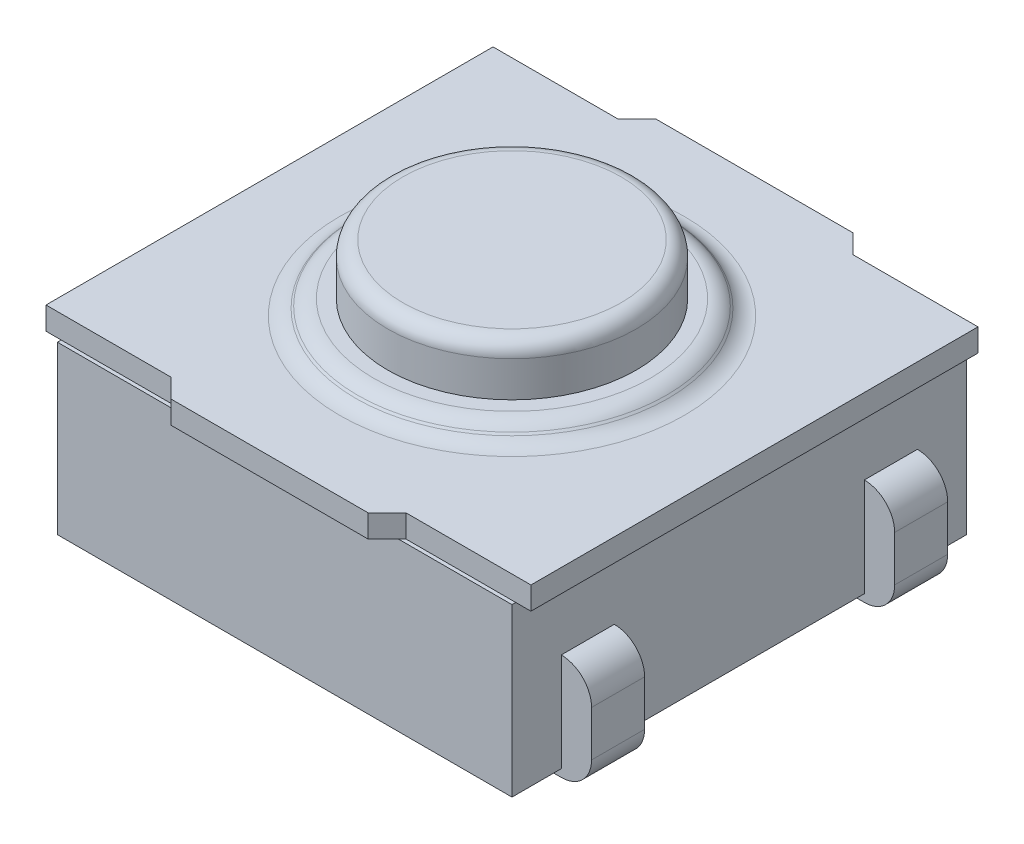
ISO-10303-21;
HEADER;
FILE_DESCRIPTION(('STEP AP214'),'2;1');
FILE_NAME('part.step','',(''),(''),'','','');
FILE_SCHEMA(('AUTOMOTIVE_DESIGN { 1 0 10303 214 1 1 1 1 }'));
ENDSEC;
DATA;
#1=APPLICATION_CONTEXT('core data for automotive mechanical design processes');
#2=APPLICATION_PROTOCOL_DEFINITION('international standard','automotive_design',2000,#1);
#3=PRODUCT_CONTEXT('',#1,'mechanical');
#4=PRODUCT('Part','Part','',(#3));
#5=PRODUCT_RELATED_PRODUCT_CATEGORY('part','',(#4));
#6=PRODUCT_DEFINITION_FORMATION('','',#4);
#7=PRODUCT_DEFINITION_CONTEXT('part definition',#1,'design');
#8=PRODUCT_DEFINITION('design','',#6,#7);
#9=PRODUCT_DEFINITION_SHAPE('','',#8);
#10=(LENGTH_UNIT() NAMED_UNIT(*) SI_UNIT(.MILLI.,.METRE.));
#11=(NAMED_UNIT(*) PLANE_ANGLE_UNIT() SI_UNIT($,.RADIAN.));
#12=(NAMED_UNIT(*) SI_UNIT($,.STERADIAN.) SOLID_ANGLE_UNIT());
#13=UNCERTAINTY_MEASURE_WITH_UNIT(LENGTH_MEASURE(1.E-05),#10,'distance_accuracy_value','');
#14=(GEOMETRIC_REPRESENTATION_CONTEXT(3) GLOBAL_UNCERTAINTY_ASSIGNED_CONTEXT((#13)) GLOBAL_UNIT_ASSIGNED_CONTEXT((#10,
#11,#12)) REPRESENTATION_CONTEXT('',''));
#15=CARTESIAN_POINT('',(0.,0.,0.));
#16=DIRECTION('',(0.,0.,1.));
#17=DIRECTION('',(1.,0.,0.));
#18=AXIS2_PLACEMENT_3D('',#15,#16,#17);
#19=CARTESIAN_POINT('',(3.,2.3,3.));
#20=DIRECTION('',(-1.,0.,0.));
#21=DIRECTION('',(0.,0.,1.));
#22=AXIS2_PLACEMENT_3D('',#19,#20,#21);
#23=PLANE('',#22);
#24=DIRECTION('',(0.,0.,1.));
#25=VECTOR('',#24,1.);
#26=CARTESIAN_POINT('',(3.,1.4,-2.35));
#27=LINE('',#26,#25);
#28=CARTESIAN_POINT('',(3.,1.4,-2.35));
#29=VERTEX_POINT('',#28);
#30=CARTESIAN_POINT('',(3.,1.4,-1.65));
#31=VERTEX_POINT('',#30);
#32=EDGE_CURVE('E348',#29,#31,#27,.T.);
#33=ORIENTED_EDGE('',*,*,#32,.F.);
#34=DIRECTION('',(0.,-1.,0.));
#35=VECTOR('',#34,1.);
#36=CARTESIAN_POINT('',(3.,2.3,-2.35));
#37=LINE('',#36,#35);
#38=CARTESIAN_POINT('',(3.,0.1,-2.35));
#39=VERTEX_POINT('',#38);
#40=EDGE_CURVE('E358',#29,#39,#37,.T.);
#41=ORIENTED_EDGE('',*,*,#40,.T.);
#42=DIRECTION('',(0.,0.,-1.));
#43=VECTOR('',#42,1.);
#44=CARTESIAN_POINT('',(3.,0.1,3.));
#45=LINE('',#44,#43);
#46=CARTESIAN_POINT('',(3.,0.1,-3.));
#47=VERTEX_POINT('',#46);
#48=EDGE_CURVE('E632',#39,#47,#45,.T.);
#49=ORIENTED_EDGE('',*,*,#48,.T.);
#50=DIRECTION('',(0.,-1.,0.));
#51=VECTOR('',#50,1.);
#52=CARTESIAN_POINT('',(3.,2.3,-3.));
#53=LINE('',#52,#51);
#54=CARTESIAN_POINT('',(3.,2.3,-3.));
#55=VERTEX_POINT('',#54);
#56=EDGE_CURVE('E662',#55,#47,#53,.T.);
#57=ORIENTED_EDGE('',*,*,#56,.F.);
#58=DIRECTION('',(0.,0.,-1.));
#59=VECTOR('',#58,1.);
#60=CARTESIAN_POINT('',(3.,2.3,3.));
#61=LINE('',#60,#59);
#62=CARTESIAN_POINT('',(3.,2.3,-2.95));
#63=VERTEX_POINT('',#62);
#64=EDGE_CURVE('E648',#63,#55,#61,.T.);
#65=ORIENTED_EDGE('',*,*,#64,.F.);
#66=CARTESIAN_POINT('',(3.,2.3,2.95));
#67=VERTEX_POINT('',#66);
#68=EDGE_CURVE('E654',#67,#63,#61,.T.);
#69=ORIENTED_EDGE('',*,*,#68,.F.);
#70=CARTESIAN_POINT('',(3.,2.3,3.));
#71=VERTEX_POINT('',#70);
#72=EDGE_CURVE('E650',#71,#67,#61,.T.);
#73=ORIENTED_EDGE('',*,*,#72,.F.);
#74=DIRECTION('',(0.,-1.,0.));
#75=VECTOR('',#74,1.);
#76=CARTESIAN_POINT('',(3.,2.3,3.));
#77=LINE('',#76,#75);
#78=CARTESIAN_POINT('',(3.,0.1,3.));
#79=VERTEX_POINT('',#78);
#80=EDGE_CURVE('E665',#71,#79,#77,.T.);
#81=ORIENTED_EDGE('',*,*,#80,.T.);
#82=CARTESIAN_POINT('',(3.,0.1,2.35));
#83=VERTEX_POINT('',#82);
#84=EDGE_CURVE('E633',#79,#83,#45,.T.);
#85=ORIENTED_EDGE('',*,*,#84,.T.);
#86=DIRECTION('',(0.,1.,0.));
#87=VECTOR('',#86,1.);
#88=CARTESIAN_POINT('',(3.,2.3,2.35));
#89=LINE('',#88,#87);
#90=CARTESIAN_POINT('',(3.,1.4,2.35));
#91=VERTEX_POINT('',#90);
#92=EDGE_CURVE('E683',#83,#91,#89,.T.);
#93=ORIENTED_EDGE('',*,*,#92,.T.);
#94=DIRECTION('',(0.,0.,-1.));
#95=VECTOR('',#94,1.);
#96=CARTESIAN_POINT('',(3.,1.4,2.35));
#97=LINE('',#96,#95);
#98=CARTESIAN_POINT('',(3.,1.4,1.65));
#99=VERTEX_POINT('',#98);
#100=EDGE_CURVE('E451',#91,#99,#97,.T.);
#101=ORIENTED_EDGE('',*,*,#100,.T.);
#102=DIRECTION('',(0.,1.,0.));
#103=VECTOR('',#102,1.);
#104=CARTESIAN_POINT('',(3.,2.3,1.65));
#105=LINE('',#104,#103);
#106=CARTESIAN_POINT('',(3.,0.1,1.65));
#107=VERTEX_POINT('',#106);
#108=EDGE_CURVE('E681',#107,#99,#105,.T.);
#109=ORIENTED_EDGE('',*,*,#108,.F.);
#110=CARTESIAN_POINT('',(3.,0.1,-1.65));
#111=VERTEX_POINT('',#110);
#112=EDGE_CURVE('E637',#107,#111,#45,.T.);
#113=ORIENTED_EDGE('',*,*,#112,.T.);
#114=DIRECTION('',(0.,-1.,0.));
#115=VECTOR('',#114,1.);
#116=CARTESIAN_POINT('',(3.,2.3,-1.65));
#117=LINE('',#116,#115);
#118=EDGE_CURVE('E695',#31,#111,#117,.T.);
#119=ORIENTED_EDGE('',*,*,#118,.F.);
#120=EDGE_LOOP('',(#33,#41,#49,#57,#65,#69,#73,#81,#85,#93,#101,#109,#113,#119));
#121=FACE_BOUND('',#120,.T.);
#122=ADVANCED_FACE('F32',(#121),#23,.F.);
#123=CARTESIAN_POINT('',(-3.,2.3,3.));
#124=DIRECTION('',(1.,0.,0.));
#125=DIRECTION('',(0.,0.,-1.));
#126=AXIS2_PLACEMENT_3D('',#123,#124,#125);
#127=PLANE('',#126);
#128=DIRECTION('',(0.,-1.,0.));
#129=VECTOR('',#128,1.);
#130=CARTESIAN_POINT('',(-3.,2.3,-2.35));
#131=LINE('',#130,#129);
#132=CARTESIAN_POINT('',(-3.,1.4,-2.35));
#133=VERTEX_POINT('',#132);
#134=CARTESIAN_POINT('',(-3.,0.1,-2.35));
#135=VERTEX_POINT('',#134);
#136=EDGE_CURVE('E435',#133,#135,#131,.T.);
#137=ORIENTED_EDGE('',*,*,#136,.F.);
#138=DIRECTION('',(0.,0.,1.));
#139=VECTOR('',#138,1.);
#140=CARTESIAN_POINT('',(-3.,1.4,-2.35));
#141=LINE('',#140,#139);
#142=CARTESIAN_POINT('',(-3.,1.4,-1.65));
#143=VERTEX_POINT('',#142);
#144=EDGE_CURVE('E433',#133,#143,#141,.T.);
#145=ORIENTED_EDGE('',*,*,#144,.T.);
#146=DIRECTION('',(0.,1.,0.));
#147=VECTOR('',#146,1.);
#148=CARTESIAN_POINT('',(-3.,1.4,-1.65));
#149=LINE('',#148,#147);
#150=CARTESIAN_POINT('',(-3.,0.1,-1.65));
#151=VERTEX_POINT('',#150);
#152=EDGE_CURVE('E412',#151,#143,#149,.T.);
#153=ORIENTED_EDGE('',*,*,#152,.F.);
#154=DIRECTION('',(0.,0.,1.));
#155=VECTOR('',#154,1.);
#156=CARTESIAN_POINT('',(-3.,0.1,3.));
#157=LINE('',#156,#155);
#158=CARTESIAN_POINT('',(-3.,0.1,1.65));
#159=VERTEX_POINT('',#158);
#160=EDGE_CURVE('E630',#151,#159,#157,.T.);
#161=ORIENTED_EDGE('',*,*,#160,.T.);
#162=DIRECTION('',(0.,1.,0.));
#163=VECTOR('',#162,1.);
#164=CARTESIAN_POINT('',(-3.,1.4,1.65));
#165=LINE('',#164,#163);
#166=CARTESIAN_POINT('',(-3.,1.4,1.65));
#167=VERTEX_POINT('',#166);
#168=EDGE_CURVE('E485',#159,#167,#165,.T.);
#169=ORIENTED_EDGE('',*,*,#168,.T.);
#170=DIRECTION('',(0.,0.,-1.));
#171=VECTOR('',#170,1.);
#172=CARTESIAN_POINT('',(-3.,1.4,2.35));
#173=LINE('',#172,#171);
#174=CARTESIAN_POINT('',(-3.,1.4,2.35));
#175=VERTEX_POINT('',#174);
#176=EDGE_CURVE('E494',#175,#167,#173,.T.);
#177=ORIENTED_EDGE('',*,*,#176,.F.);
#178=DIRECTION('',(0.,1.,0.));
#179=VECTOR('',#178,1.);
#180=CARTESIAN_POINT('',(-3.,2.3,2.35));
#181=LINE('',#180,#179);
#182=CARTESIAN_POINT('',(-3.,0.1,2.35));
#183=VERTEX_POINT('',#182);
#184=EDGE_CURVE('E521',#183,#175,#181,.T.);
#185=ORIENTED_EDGE('',*,*,#184,.F.);
#186=CARTESIAN_POINT('',(-3.,0.1,3.));
#187=VERTEX_POINT('',#186);
#188=EDGE_CURVE('E625',#183,#187,#157,.T.);
#189=ORIENTED_EDGE('',*,*,#188,.T.);
#190=DIRECTION('',(0.,-1.,0.));
#191=VECTOR('',#190,1.);
#192=CARTESIAN_POINT('',(-3.,2.3,3.));
#193=LINE('',#192,#191);
#194=CARTESIAN_POINT('',(-3.,2.3,3.));
#195=VERTEX_POINT('',#194);
#196=EDGE_CURVE('E668',#195,#187,#193,.T.);
#197=ORIENTED_EDGE('',*,*,#196,.F.);
#198=DIRECTION('',(0.,0.,1.));
#199=VECTOR('',#198,1.);
#200=CARTESIAN_POINT('',(-3.,2.3,3.));
#201=LINE('',#200,#199);
#202=CARTESIAN_POINT('',(-3.,2.3,2.95));
#203=VERTEX_POINT('',#202);
#204=EDGE_CURVE('E639',#203,#195,#201,.T.);
#205=ORIENTED_EDGE('',*,*,#204,.F.);
#206=CARTESIAN_POINT('',(-3.,2.3,-2.95));
#207=VERTEX_POINT('',#206);
#208=EDGE_CURVE('E644',#207,#203,#201,.T.);
#209=ORIENTED_EDGE('',*,*,#208,.F.);
#210=CARTESIAN_POINT('',(-3.,2.3,-3.));
#211=VERTEX_POINT('',#210);
#212=EDGE_CURVE('E640',#211,#207,#201,.T.);
#213=ORIENTED_EDGE('',*,*,#212,.F.);
#214=DIRECTION('',(0.,-1.,0.));
#215=VECTOR('',#214,1.);
#216=CARTESIAN_POINT('',(-3.,2.3,-3.));
#217=LINE('',#216,#215);
#218=CARTESIAN_POINT('',(-3.,0.1,-3.));
#219=VERTEX_POINT('',#218);
#220=EDGE_CURVE('E658',#211,#219,#217,.T.);
#221=ORIENTED_EDGE('',*,*,#220,.T.);
#222=EDGE_CURVE('E626',#219,#135,#157,.T.);
#223=ORIENTED_EDGE('',*,*,#222,.T.);
#224=EDGE_LOOP('',(#137,#145,#153,#161,#169,#177,#185,#189,#197,#205,#209,#213,#221,#223));
#225=FACE_BOUND('',#224,.T.);
#226=ADVANCED_FACE('F751',(#225),#127,.F.);
#227=CARTESIAN_POINT('',(-3.,0.1,-3.));
#228=DIRECTION('',(0.,-1.,0.));
#229=DIRECTION('',(0.,0.,-1.));
#230=AXIS2_PLACEMENT_3D('',#227,#228,#229);
#231=PLANE('',#230);
#232=DIRECTION('',(1.,0.,0.));
#233=VECTOR('',#232,1.);
#234=CARTESIAN_POINT('',(-3.,0.1,-2.35));
#235=LINE('',#234,#233);
#236=CARTESIAN_POINT('',(1.53542486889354,0.1,-2.35));
#237=VERTEX_POINT('',#236);
#238=EDGE_CURVE('E47',#237,#39,#235,.T.);
#239=ORIENTED_EDGE('',*,*,#238,.F.);
#240=DIRECTION('',(0.,0.,1.));
#241=VECTOR('',#240,1.);
#242=CARTESIAN_POINT('',(1.53542486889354,0.1,-2.35));
#243=LINE('',#242,#241);
#244=CARTESIAN_POINT('',(1.53542486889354,0.1,-1.65));
#245=VERTEX_POINT('',#244);
#246=EDGE_CURVE('E51',#245,#237,#243,.F.);
#247=ORIENTED_EDGE('',*,*,#246,.F.);
#248=DIRECTION('',(1.,0.,0.));
#249=VECTOR('',#248,1.);
#250=CARTESIAN_POINT('',(-3.,0.1,-1.65));
#251=LINE('',#250,#249);
#252=EDGE_CURVE('E389',#245,#111,#251,.T.);
#253=ORIENTED_EDGE('',*,*,#252,.T.);
#254=ORIENTED_EDGE('',*,*,#112,.F.);
#255=DIRECTION('',(-1.,0.,0.));
#256=VECTOR('',#255,1.);
#257=CARTESIAN_POINT('',(-3.,0.1,1.65));
#258=LINE('',#257,#256);
#259=CARTESIAN_POINT('',(1.53542486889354,0.1,1.65));
#260=VERTEX_POINT('',#259);
#261=EDGE_CURVE('E475',#107,#260,#258,.T.);
#262=ORIENTED_EDGE('',*,*,#261,.T.);
#263=DIRECTION('',(0.,0.,-1.));
#264=VECTOR('',#263,1.);
#265=CARTESIAN_POINT('',(1.53542486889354,0.1,2.35));
#266=LINE('',#265,#264);
#267=CARTESIAN_POINT('',(1.53542486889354,0.1,2.35));
#268=VERTEX_POINT('',#267);
#269=EDGE_CURVE('E685',#260,#268,#266,.F.);
#270=ORIENTED_EDGE('',*,*,#269,.T.);
#271=DIRECTION('',(-1.,0.,0.));
#272=VECTOR('',#271,1.);
#273=CARTESIAN_POINT('',(-3.,0.1,2.35));
#274=LINE('',#273,#272);
#275=EDGE_CURVE('E477',#83,#268,#274,.T.);
#276=ORIENTED_EDGE('',*,*,#275,.F.);
#277=ORIENTED_EDGE('',*,*,#84,.F.);
#278=DIRECTION('',(1.,0.,0.));
#279=VECTOR('',#278,1.);
#280=CARTESIAN_POINT('',(-3.,0.1,3.));
#281=LINE('',#280,#279);
#282=EDGE_CURVE('E629',#187,#79,#281,.T.);
#283=ORIENTED_EDGE('',*,*,#282,.F.);
#284=ORIENTED_EDGE('',*,*,#188,.F.);
#285=DIRECTION('',(1.,0.,0.));
#286=VECTOR('',#285,1.);
#287=CARTESIAN_POINT('',(-3.,0.1,2.35));
#288=LINE('',#287,#286);
#289=CARTESIAN_POINT('',(-1.53542486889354,0.1,2.35));
#290=VERTEX_POINT('',#289);
#291=EDGE_CURVE('E679',#183,#290,#288,.T.);
#292=ORIENTED_EDGE('',*,*,#291,.T.);
#293=DIRECTION('',(0.,0.,-1.));
#294=VECTOR('',#293,1.);
#295=CARTESIAN_POINT('',(-1.53542486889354,0.1,2.35));
#296=LINE('',#295,#294);
#297=CARTESIAN_POINT('',(-1.53542486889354,0.1,1.65));
#298=VERTEX_POINT('',#297);
#299=EDGE_CURVE('E677',#290,#298,#296,.T.);
#300=ORIENTED_EDGE('',*,*,#299,.T.);
#301=DIRECTION('',(1.,0.,0.));
#302=VECTOR('',#301,1.);
#303=CARTESIAN_POINT('',(-3.,0.1,1.65));
#304=LINE('',#303,#302);
#305=EDGE_CURVE('E674',#159,#298,#304,.T.);
#306=ORIENTED_EDGE('',*,*,#305,.F.);
#307=ORIENTED_EDGE('',*,*,#160,.F.);
#308=DIRECTION('',(-1.,0.,0.));
#309=VECTOR('',#308,1.);
#310=CARTESIAN_POINT('',(-3.,0.1,-1.65));
#311=LINE('',#310,#309);
#312=CARTESIAN_POINT('',(-1.53542486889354,0.1,-1.65));
#313=VERTEX_POINT('',#312);
#314=EDGE_CURVE('E687',#313,#151,#311,.T.);
#315=ORIENTED_EDGE('',*,*,#314,.F.);
#316=DIRECTION('',(0.,0.,1.));
#317=VECTOR('',#316,1.);
#318=CARTESIAN_POINT('',(-1.53542486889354,0.1,-2.35));
#319=LINE('',#318,#317);
#320=CARTESIAN_POINT('',(-1.53542486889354,0.1,-2.35));
#321=VERTEX_POINT('',#320);
#322=EDGE_CURVE('E690',#321,#313,#319,.T.);
#323=ORIENTED_EDGE('',*,*,#322,.F.);
#324=DIRECTION('',(-1.,0.,0.));
#325=VECTOR('',#324,1.);
#326=CARTESIAN_POINT('',(-3.,0.1,-2.35));
#327=LINE('',#326,#325);
#328=EDGE_CURVE('E693',#321,#135,#327,.T.);
#329=ORIENTED_EDGE('',*,*,#328,.T.);
#330=ORIENTED_EDGE('',*,*,#222,.F.);
#331=DIRECTION('',(-1.,0.,0.));
#332=VECTOR('',#331,1.);
#333=CARTESIAN_POINT('',(-3.,0.1,-3.));
#334=LINE('',#333,#332);
#335=EDGE_CURVE('E636',#47,#219,#334,.T.);
#336=ORIENTED_EDGE('',*,*,#335,.F.);
#337=ORIENTED_EDGE('',*,*,#48,.F.);
#338=EDGE_LOOP('',(#239,#247,#253,#254,#262,#270,#276,#277,#283,#284,#292,#300,#306,#307,#315,
#323,#329,#330,#336,#337));
#339=FACE_BOUND('',#338,.T.);
#340=ADVANCED_FACE('F757',(#339),#231,.T.);
#341=CARTESIAN_POINT('',(-3.,2.3,-3.));
#342=DIRECTION('',(0.,-1.,0.));
#343=DIRECTION('',(0.,0.,-1.));
#344=AXIS2_PLACEMENT_3D('',#341,#342,#343);
#345=PLANE('',#344);
#346=DIRECTION('',(-1.,0.,0.));
#347=VECTOR('',#346,1.);
#348=CARTESIAN_POINT('',(-3.2,2.3,-2.95));
#349=LINE('',#348,#347);
#350=CARTESIAN_POINT('',(-1.55,2.3,-2.95));
#351=VERTEX_POINT('',#350);
#352=EDGE_CURVE('E561',#351,#207,#349,.T.);
#353=ORIENTED_EDGE('',*,*,#352,.F.);
#354=DIRECTION('',(-0.707106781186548,0.,0.707106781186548));
#355=VECTOR('',#354,1.);
#356=CARTESIAN_POINT('',(-1.55,2.3,-2.95));
#357=LINE('',#356,#355);
#358=CARTESIAN_POINT('',(-1.5,2.3,-3.));
#359=VERTEX_POINT('',#358);
#360=EDGE_CURVE('E560',#359,#351,#357,.T.);
#361=ORIENTED_EDGE('',*,*,#360,.F.);
#362=DIRECTION('',(-1.,0.,0.));
#363=VECTOR('',#362,1.);
#364=CARTESIAN_POINT('',(-3.,2.3,-3.));
#365=LINE('',#364,#363);
#366=EDGE_CURVE('E653',#359,#211,#365,.T.);
#367=ORIENTED_EDGE('',*,*,#366,.T.);
#368=ORIENTED_EDGE('',*,*,#212,.T.);
#369=EDGE_LOOP('',(#353,#361,#367,#368));
#370=FACE_BOUND('',#369,.T.);
#371=ADVANCED_FACE('F951',(#370),#345,.F.);
#372=DIRECTION('',(-0.707106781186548,0.,-0.707106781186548));
#373=VECTOR('',#372,1.);
#374=CARTESIAN_POINT('',(1.55,2.3,-2.95));
#375=LINE('',#374,#373);
#376=CARTESIAN_POINT('',(1.55,2.3,-2.95));
#377=VERTEX_POINT('',#376);
#378=CARTESIAN_POINT('',(1.5,2.3,-3.));
#379=VERTEX_POINT('',#378);
#380=EDGE_CURVE('E551',#377,#379,#375,.T.);
#381=ORIENTED_EDGE('',*,*,#380,.F.);
#382=DIRECTION('',(-1.,0.,0.));
#383=VECTOR('',#382,1.);
#384=CARTESIAN_POINT('',(3.2,2.3,-2.95));
#385=LINE('',#384,#383);
#386=EDGE_CURVE('E550',#63,#377,#385,.T.);
#387=ORIENTED_EDGE('',*,*,#386,.F.);
#388=ORIENTED_EDGE('',*,*,#64,.T.);
#389=EDGE_CURVE('E655',#55,#379,#365,.T.);
#390=ORIENTED_EDGE('',*,*,#389,.T.);
#391=EDGE_LOOP('',(#381,#387,#388,#390));
#392=FACE_BOUND('',#391,.T.);
#393=ADVANCED_FACE('F975',(#392),#345,.F.);
#394=DIRECTION('',(1.,0.,0.));
#395=VECTOR('',#394,1.);
#396=CARTESIAN_POINT('',(3.2,2.3,2.95));
#397=LINE('',#396,#395);
#398=CARTESIAN_POINT('',(1.55,2.3,2.95));
#399=VERTEX_POINT('',#398);
#400=EDGE_CURVE('E541',#399,#67,#397,.T.);
#401=ORIENTED_EDGE('',*,*,#400,.F.);
#402=DIRECTION('',(0.707106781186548,0.,-0.707106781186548));
#403=VECTOR('',#402,1.);
#404=CARTESIAN_POINT('',(1.55,2.3,2.95));
#405=LINE('',#404,#403);
#406=CARTESIAN_POINT('',(1.5,2.3,3.));
#407=VERTEX_POINT('',#406);
#408=EDGE_CURVE('E540',#407,#399,#405,.T.);
#409=ORIENTED_EDGE('',*,*,#408,.F.);
#410=DIRECTION('',(1.,0.,0.));
#411=VECTOR('',#410,1.);
#412=CARTESIAN_POINT('',(-3.,2.3,3.));
#413=LINE('',#412,#411);
#414=EDGE_CURVE('E643',#407,#71,#413,.T.);
#415=ORIENTED_EDGE('',*,*,#414,.T.);
#416=ORIENTED_EDGE('',*,*,#72,.T.);
#417=EDGE_LOOP('',(#401,#409,#415,#416));
#418=FACE_BOUND('',#417,.T.);
#419=ADVANCED_FACE('F979',(#418),#345,.F.);
#420=DIRECTION('',(0.707106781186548,0.,0.707106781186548));
#421=VECTOR('',#420,1.);
#422=CARTESIAN_POINT('',(-1.55,2.3,2.95));
#423=LINE('',#422,#421);
#424=CARTESIAN_POINT('',(-1.55,2.3,2.95));
#425=VERTEX_POINT('',#424);
#426=CARTESIAN_POINT('',(-1.5,2.3,3.));
#427=VERTEX_POINT('',#426);
#428=EDGE_CURVE('E531',#425,#427,#423,.T.);
#429=ORIENTED_EDGE('',*,*,#428,.F.);
#430=DIRECTION('',(1.,0.,0.));
#431=VECTOR('',#430,1.);
#432=CARTESIAN_POINT('',(-3.2,2.3,2.95));
#433=LINE('',#432,#431);
#434=EDGE_CURVE('E530',#203,#425,#433,.T.);
#435=ORIENTED_EDGE('',*,*,#434,.F.);
#436=ORIENTED_EDGE('',*,*,#204,.T.);
#437=EDGE_CURVE('E645',#195,#427,#413,.T.);
#438=ORIENTED_EDGE('',*,*,#437,.T.);
#439=EDGE_LOOP('',(#429,#435,#436,#438));
#440=FACE_BOUND('',#439,.T.);
#441=ADVANCED_FACE('F766',(#440),#345,.F.);
#442=CARTESIAN_POINT('',(-3.,2.3,3.));
#443=DIRECTION('',(0.,0.,-1.));
#444=DIRECTION('',(-1.,0.,0.));
#445=AXIS2_PLACEMENT_3D('',#442,#443,#444);
#446=PLANE('',#445);
#447=ORIENTED_EDGE('',*,*,#282,.T.);
#448=ORIENTED_EDGE('',*,*,#80,.F.);
#449=ORIENTED_EDGE('',*,*,#414,.F.);
#450=EDGE_CURVE('E649',#427,#407,#413,.T.);
#451=ORIENTED_EDGE('',*,*,#450,.F.);
#452=ORIENTED_EDGE('',*,*,#437,.F.);
#453=ORIENTED_EDGE('',*,*,#196,.T.);
#454=EDGE_LOOP('',(#447,#448,#449,#451,#452,#453));
#455=FACE_BOUND('',#454,.T.);
#456=ADVANCED_FACE('F764',(#455),#446,.F.);
#457=CARTESIAN_POINT('',(-3.,2.3,-3.));
#458=DIRECTION('',(0.,0.,1.));
#459=DIRECTION('',(1.,0.,0.));
#460=AXIS2_PLACEMENT_3D('',#457,#458,#459);
#461=PLANE('',#460);
#462=ORIENTED_EDGE('',*,*,#335,.T.);
#463=ORIENTED_EDGE('',*,*,#220,.F.);
#464=ORIENTED_EDGE('',*,*,#366,.F.);
#465=EDGE_CURVE('E659',#379,#359,#365,.T.);
#466=ORIENTED_EDGE('',*,*,#465,.F.);
#467=ORIENTED_EDGE('',*,*,#389,.F.);
#468=ORIENTED_EDGE('',*,*,#56,.T.);
#469=EDGE_LOOP('',(#462,#463,#464,#466,#467,#468));
#470=FACE_BOUND('',#469,.T.);
#471=ADVANCED_FACE('F762',(#470),#461,.F.);
#472=CARTESIAN_POINT('',(-3.2,2.3,2.95));
#473=DIRECTION('',(0.,1.,0.));
#474=DIRECTION('',(0.,0.,1.));
#475=AXIS2_PLACEMENT_3D('',#472,#473,#474);
#476=PLANE('',#475);
#477=CARTESIAN_POINT('',(-3.2,2.3,-2.95));
#478=VERTEX_POINT('',#477);
#479=EDGE_CURVE('E559',#207,#478,#349,.T.);
#480=ORIENTED_EDGE('',*,*,#479,.F.);
#481=ORIENTED_EDGE('',*,*,#208,.T.);
#482=CARTESIAN_POINT('',(-3.2,2.3,2.95));
#483=VERTEX_POINT('',#482);
#484=EDGE_CURVE('E526',#483,#203,#433,.T.);
#485=ORIENTED_EDGE('',*,*,#484,.F.);
#486=DIRECTION('',(0.,0.,1.));
#487=VECTOR('',#486,1.);
#488=CARTESIAN_POINT('',(-3.2,2.3,-2.95));
#489=LINE('',#488,#487);
#490=EDGE_CURVE('E523',#478,#483,#489,.T.);
#491=ORIENTED_EDGE('',*,*,#490,.F.);
#492=EDGE_LOOP('',(#480,#481,#485,#491));
#493=FACE_BOUND('',#492,.T.);
#494=ADVANCED_FACE('F958',(#493),#476,.F.);
#495=CARTESIAN_POINT('',(-1.3,2.3,3.2));
#496=VERTEX_POINT('',#495);
#497=EDGE_CURVE('E529',#427,#496,#423,.T.);
#498=ORIENTED_EDGE('',*,*,#497,.F.);
#499=ORIENTED_EDGE('',*,*,#450,.T.);
#500=CARTESIAN_POINT('',(1.3,2.3,3.2));
#501=VERTEX_POINT('',#500);
#502=EDGE_CURVE('E536',#501,#407,#405,.T.);
#503=ORIENTED_EDGE('',*,*,#502,.F.);
#504=DIRECTION('',(1.,0.,0.));
#505=VECTOR('',#504,1.);
#506=CARTESIAN_POINT('',(-1.3,2.3,3.2));
#507=LINE('',#506,#505);
#508=EDGE_CURVE('E534',#496,#501,#507,.T.);
#509=ORIENTED_EDGE('',*,*,#508,.F.);
#510=EDGE_LOOP('',(#498,#499,#503,#509));
#511=FACE_BOUND('',#510,.T.);
#512=ADVANCED_FACE('F911',(#511),#476,.F.);
#513=CARTESIAN_POINT('',(3.2,2.3,2.95));
#514=VERTEX_POINT('',#513);
#515=EDGE_CURVE('E539',#67,#514,#397,.T.);
#516=ORIENTED_EDGE('',*,*,#515,.F.);
#517=ORIENTED_EDGE('',*,*,#68,.T.);
#518=CARTESIAN_POINT('',(3.2,2.3,-2.95));
#519=VERTEX_POINT('',#518);
#520=EDGE_CURVE('E546',#519,#63,#385,.T.);
#521=ORIENTED_EDGE('',*,*,#520,.F.);
#522=DIRECTION('',(0.,0.,-1.));
#523=VECTOR('',#522,1.);
#524=CARTESIAN_POINT('',(3.2,2.3,-2.95));
#525=LINE('',#524,#523);
#526=EDGE_CURVE('E544',#514,#519,#525,.T.);
#527=ORIENTED_EDGE('',*,*,#526,.F.);
#528=EDGE_LOOP('',(#516,#517,#521,#527));
#529=FACE_BOUND('',#528,.T.);
#530=ADVANCED_FACE('F969',(#529),#476,.F.);
#531=CARTESIAN_POINT('',(1.3,2.3,-3.2));
#532=VERTEX_POINT('',#531);
#533=EDGE_CURVE('E549',#379,#532,#375,.T.);
#534=ORIENTED_EDGE('',*,*,#533,.F.);
#535=ORIENTED_EDGE('',*,*,#465,.T.);
#536=CARTESIAN_POINT('',(-1.3,2.3,-3.2));
#537=VERTEX_POINT('',#536);
#538=EDGE_CURVE('E556',#537,#359,#357,.T.);
#539=ORIENTED_EDGE('',*,*,#538,.F.);
#540=DIRECTION('',(-1.,0.,0.));
#541=VECTOR('',#540,1.);
#542=CARTESIAN_POINT('',(-1.3,2.3,-3.2));
#543=LINE('',#542,#541);
#544=EDGE_CURVE('E554',#532,#537,#543,.T.);
#545=ORIENTED_EDGE('',*,*,#544,.F.);
#546=EDGE_LOOP('',(#534,#535,#539,#545));
#547=FACE_BOUND('',#546,.T.);
#548=ADVANCED_FACE('F947',(#547),#476,.F.);
#549=CARTESIAN_POINT('',(-3.2,2.6,-2.95));
#550=DIRECTION('',(1.,0.,0.));
#551=DIRECTION('',(0.,0.,-1.));
#552=AXIS2_PLACEMENT_3D('',#549,#550,#551);
#553=PLANE('',#552);
#554=ORIENTED_EDGE('',*,*,#490,.T.);
#555=DIRECTION('',(0.,-1.,0.));
#556=VECTOR('',#555,1.);
#557=CARTESIAN_POINT('',(-3.2,2.6,2.95));
#558=LINE('',#557,#556);
#559=CARTESIAN_POINT('',(-3.2,2.6,2.95));
#560=VERTEX_POINT('',#559);
#561=EDGE_CURVE('E622',#560,#483,#558,.T.);
#562=ORIENTED_EDGE('',*,*,#561,.F.);
#563=DIRECTION('',(0.,0.,1.));
#564=VECTOR('',#563,1.);
#565=CARTESIAN_POINT('',(-3.2,2.6,-2.95));
#566=LINE('',#565,#564);
#567=CARTESIAN_POINT('',(-3.2,2.6,-2.95));
#568=VERTEX_POINT('',#567);
#569=EDGE_CURVE('E564',#568,#560,#566,.T.);
#570=ORIENTED_EDGE('',*,*,#569,.F.);
#571=DIRECTION('',(0.,-1.,0.));
#572=VECTOR('',#571,1.);
#573=CARTESIAN_POINT('',(-3.2,2.6,-2.95));
#574=LINE('',#573,#572);
#575=EDGE_CURVE('E589',#568,#478,#574,.T.);
#576=ORIENTED_EDGE('',*,*,#575,.T.);
#577=EDGE_LOOP('',(#554,#562,#570,#576));
#578=FACE_BOUND('',#577,.T.);
#579=ADVANCED_FACE('F961',(#578),#553,.F.);
#580=CARTESIAN_POINT('',(-3.2,2.6,2.95));
#581=DIRECTION('',(0.,0.,-1.));
#582=DIRECTION('',(-1.,0.,0.));
#583=AXIS2_PLACEMENT_3D('',#580,#581,#582);
#584=PLANE('',#583);
#585=ORIENTED_EDGE('',*,*,#484,.T.);
#586=ORIENTED_EDGE('',*,*,#434,.T.);
#587=DIRECTION('',(0.,-1.,0.));
#588=VECTOR('',#587,1.);
#589=CARTESIAN_POINT('',(-1.55,2.6,2.95));
#590=LINE('',#589,#588);
#591=CARTESIAN_POINT('',(-1.55,2.6,2.95));
#592=VERTEX_POINT('',#591);
#593=EDGE_CURVE('E619',#592,#425,#590,.T.);
#594=ORIENTED_EDGE('',*,*,#593,.F.);
#595=DIRECTION('',(1.,0.,0.));
#596=VECTOR('',#595,1.);
#597=CARTESIAN_POINT('',(-3.2,2.6,2.95));
#598=LINE('',#597,#596);
#599=EDGE_CURVE('E567',#560,#592,#598,.T.);
#600=ORIENTED_EDGE('',*,*,#599,.F.);
#601=ORIENTED_EDGE('',*,*,#561,.T.);
#602=EDGE_LOOP('',(#585,#586,#594,#600,#601));
#603=FACE_BOUND('',#602,.T.);
#604=ADVANCED_FACE('F919',(#603),#584,.F.);
#605=CARTESIAN_POINT('',(-1.55,2.6,2.95));
#606=DIRECTION('',(0.707106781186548,0.,-0.707106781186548));
#607=DIRECTION('',(-0.707106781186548,0.,-0.707106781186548));
#608=AXIS2_PLACEMENT_3D('',#605,#606,#607);
#609=PLANE('',#608);
#610=ORIENTED_EDGE('',*,*,#428,.T.);
#611=ORIENTED_EDGE('',*,*,#497,.T.);
#612=DIRECTION('',(0.,-1.,0.));
#613=VECTOR('',#612,1.);
#614=CARTESIAN_POINT('',(-1.3,2.6,3.2));
#615=LINE('',#614,#613);
#616=CARTESIAN_POINT('',(-1.3,2.6,3.2));
#617=VERTEX_POINT('',#616);
#618=EDGE_CURVE('E616',#617,#496,#615,.T.);
#619=ORIENTED_EDGE('',*,*,#618,.F.);
#620=DIRECTION('',(0.707106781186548,0.,0.707106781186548));
#621=VECTOR('',#620,1.);
#622=CARTESIAN_POINT('',(-1.55,2.6,2.95));
#623=LINE('',#622,#621);
#624=EDGE_CURVE('E569',#592,#617,#623,.T.);
#625=ORIENTED_EDGE('',*,*,#624,.F.);
#626=ORIENTED_EDGE('',*,*,#593,.T.);
#627=EDGE_LOOP('',(#610,#611,#619,#625,#626));
#628=FACE_BOUND('',#627,.T.);
#629=ADVANCED_FACE('F915',(#628),#609,.F.);
#630=CARTESIAN_POINT('',(-1.3,2.6,3.2));
#631=DIRECTION('',(0.,0.,-1.));
#632=DIRECTION('',(-1.,0.,0.));
#633=AXIS2_PLACEMENT_3D('',#630,#631,#632);
#634=PLANE('',#633);
#635=ORIENTED_EDGE('',*,*,#508,.T.);
#636=DIRECTION('',(0.,-1.,0.));
#637=VECTOR('',#636,1.);
#638=CARTESIAN_POINT('',(1.3,2.6,3.2));
#639=LINE('',#638,#637);
#640=CARTESIAN_POINT('',(1.3,2.6,3.2));
#641=VERTEX_POINT('',#640);
#642=EDGE_CURVE('E613',#641,#501,#639,.T.);
#643=ORIENTED_EDGE('',*,*,#642,.F.);
#644=DIRECTION('',(1.,0.,0.));
#645=VECTOR('',#644,1.);
#646=CARTESIAN_POINT('',(-1.3,2.6,3.2));
#647=LINE('',#646,#645);
#648=EDGE_CURVE('E571',#617,#641,#647,.T.);
#649=ORIENTED_EDGE('',*,*,#648,.F.);
#650=ORIENTED_EDGE('',*,*,#618,.T.);
#651=EDGE_LOOP('',(#635,#643,#649,#650));
#652=FACE_BOUND('',#651,.T.);
#653=ADVANCED_FACE('F999',(#652),#634,.F.);
#654=CARTESIAN_POINT('',(1.55,2.6,2.95));
#655=DIRECTION('',(-0.707106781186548,0.,-0.707106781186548));
#656=DIRECTION('',(-0.707106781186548,0.,0.707106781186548));
#657=AXIS2_PLACEMENT_3D('',#654,#655,#656);
#658=PLANE('',#657);
#659=ORIENTED_EDGE('',*,*,#502,.T.);
#660=ORIENTED_EDGE('',*,*,#408,.T.);
#661=DIRECTION('',(0.,-1.,0.));
#662=VECTOR('',#661,1.);
#663=CARTESIAN_POINT('',(1.55,2.6,2.95));
#664=LINE('',#663,#662);
#665=CARTESIAN_POINT('',(1.55,2.6,2.95));
#666=VERTEX_POINT('',#665);
#667=EDGE_CURVE('E610',#666,#399,#664,.T.);
#668=ORIENTED_EDGE('',*,*,#667,.F.);
#669=DIRECTION('',(0.707106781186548,0.,-0.707106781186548));
#670=VECTOR('',#669,1.);
#671=CARTESIAN_POINT('',(1.55,2.6,2.95));
#672=LINE('',#671,#670);
#673=EDGE_CURVE('E573',#641,#666,#672,.T.);
#674=ORIENTED_EDGE('',*,*,#673,.F.);
#675=ORIENTED_EDGE('',*,*,#642,.T.);
#676=EDGE_LOOP('',(#659,#660,#668,#674,#675));
#677=FACE_BOUND('',#676,.T.);
#678=ADVANCED_FACE('F995',(#677),#658,.F.);
#679=CARTESIAN_POINT('',(3.2,2.6,2.95));
#680=DIRECTION('',(0.,0.,-1.));
#681=DIRECTION('',(-1.,0.,0.));
#682=AXIS2_PLACEMENT_3D('',#679,#680,#681);
#683=PLANE('',#682);
#684=ORIENTED_EDGE('',*,*,#400,.T.);
#685=ORIENTED_EDGE('',*,*,#515,.T.);
#686=DIRECTION('',(0.,-1.,0.));
#687=VECTOR('',#686,1.);
#688=CARTESIAN_POINT('',(3.2,2.6,2.95));
#689=LINE('',#688,#687);
#690=CARTESIAN_POINT('',(3.2,2.6,2.95));
#691=VERTEX_POINT('',#690);
#692=EDGE_CURVE('E607',#691,#514,#689,.T.);
#693=ORIENTED_EDGE('',*,*,#692,.F.);
#694=DIRECTION('',(1.,0.,0.));
#695=VECTOR('',#694,1.);
#696=CARTESIAN_POINT('',(3.2,2.6,2.95));
#697=LINE('',#696,#695);
#698=EDGE_CURVE('E575',#666,#691,#697,.T.);
#699=ORIENTED_EDGE('',*,*,#698,.F.);
#700=ORIENTED_EDGE('',*,*,#667,.T.);
#701=EDGE_LOOP('',(#684,#685,#693,#699,#700));
#702=FACE_BOUND('',#701,.T.);
#703=ADVANCED_FACE('F991',(#702),#683,.F.);
#704=CARTESIAN_POINT('',(3.2,2.6,-2.95));
#705=DIRECTION('',(-1.,0.,0.));
#706=DIRECTION('',(0.,0.,1.));
#707=AXIS2_PLACEMENT_3D('',#704,#705,#706);
#708=PLANE('',#707);
#709=ORIENTED_EDGE('',*,*,#526,.T.);
#710=DIRECTION('',(0.,-1.,0.));
#711=VECTOR('',#710,1.);
#712=CARTESIAN_POINT('',(3.2,2.6,-2.95));
#713=LINE('',#712,#711);
#714=CARTESIAN_POINT('',(3.2,2.6,-2.95));
#715=VERTEX_POINT('',#714);
#716=EDGE_CURVE('E604',#715,#519,#713,.T.);
#717=ORIENTED_EDGE('',*,*,#716,.F.);
#718=DIRECTION('',(0.,0.,-1.));
#719=VECTOR('',#718,1.);
#720=CARTESIAN_POINT('',(3.2,2.6,-2.95));
#721=LINE('',#720,#719);
#722=EDGE_CURVE('E577',#691,#715,#721,.T.);
#723=ORIENTED_EDGE('',*,*,#722,.F.);
#724=ORIENTED_EDGE('',*,*,#692,.T.);
#725=EDGE_LOOP('',(#709,#717,#723,#724));
#726=FACE_BOUND('',#725,.T.);
#727=ADVANCED_FACE('F1010',(#726),#708,.F.);
#728=CARTESIAN_POINT('',(3.2,2.6,-2.95));
#729=DIRECTION('',(0.,0.,1.));
#730=DIRECTION('',(1.,0.,0.));
#731=AXIS2_PLACEMENT_3D('',#728,#729,#730);
#732=PLANE('',#731);
#733=ORIENTED_EDGE('',*,*,#520,.T.);
#734=ORIENTED_EDGE('',*,*,#386,.T.);
#735=DIRECTION('',(0.,-1.,0.));
#736=VECTOR('',#735,1.);
#737=CARTESIAN_POINT('',(1.55,2.6,-2.95));
#738=LINE('',#737,#736);
#739=CARTESIAN_POINT('',(1.55,2.6,-2.95));
#740=VERTEX_POINT('',#739);
#741=EDGE_CURVE('E601',#740,#377,#738,.T.);
#742=ORIENTED_EDGE('',*,*,#741,.F.);
#743=DIRECTION('',(-1.,0.,0.));
#744=VECTOR('',#743,1.);
#745=CARTESIAN_POINT('',(3.2,2.6,-2.95));
#746=LINE('',#745,#744);
#747=EDGE_CURVE('E579',#715,#740,#746,.T.);
#748=ORIENTED_EDGE('',*,*,#747,.F.);
#749=ORIENTED_EDGE('',*,*,#716,.T.);
#750=EDGE_LOOP('',(#733,#734,#742,#748,#749));
#751=FACE_BOUND('',#750,.T.);
#752=ADVANCED_FACE('F1013',(#751),#732,.F.);
#753=CARTESIAN_POINT('',(1.55,2.6,-2.95));
#754=DIRECTION('',(-0.707106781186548,0.,0.707106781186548));
#755=DIRECTION('',(0.707106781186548,0.,0.707106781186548));
#756=AXIS2_PLACEMENT_3D('',#753,#754,#755);
#757=PLANE('',#756);
#758=ORIENTED_EDGE('',*,*,#380,.T.);
#759=ORIENTED_EDGE('',*,*,#533,.T.);
#760=DIRECTION('',(0.,-1.,0.));
#761=VECTOR('',#760,1.);
#762=CARTESIAN_POINT('',(1.3,2.6,-3.2));
#763=LINE('',#762,#761);
#764=CARTESIAN_POINT('',(1.3,2.6,-3.2));
#765=VERTEX_POINT('',#764);
#766=EDGE_CURVE('E598',#765,#532,#763,.T.);
#767=ORIENTED_EDGE('',*,*,#766,.F.);
#768=DIRECTION('',(-0.707106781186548,0.,-0.707106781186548));
#769=VECTOR('',#768,1.);
#770=CARTESIAN_POINT('',(1.55,2.6,-2.95));
#771=LINE('',#770,#769);
#772=EDGE_CURVE('E581',#740,#765,#771,.T.);
#773=ORIENTED_EDGE('',*,*,#772,.F.);
#774=ORIENTED_EDGE('',*,*,#741,.T.);
#775=EDGE_LOOP('',(#758,#759,#767,#773,#774));
#776=FACE_BOUND('',#775,.T.);
#777=ADVANCED_FACE('F1017',(#776),#757,.F.);
#778=CARTESIAN_POINT('',(-1.3,2.6,-3.2));
#779=DIRECTION('',(0.,0.,1.));
#780=DIRECTION('',(1.,0.,0.));
#781=AXIS2_PLACEMENT_3D('',#778,#779,#780);
#782=PLANE('',#781);
#783=ORIENTED_EDGE('',*,*,#544,.T.);
#784=DIRECTION('',(0.,-1.,0.));
#785=VECTOR('',#784,1.);
#786=CARTESIAN_POINT('',(-1.3,2.6,-3.2));
#787=LINE('',#786,#785);
#788=CARTESIAN_POINT('',(-1.3,2.6,-3.2));
#789=VERTEX_POINT('',#788);
#790=EDGE_CURVE('E595',#789,#537,#787,.T.);
#791=ORIENTED_EDGE('',*,*,#790,.F.);
#792=DIRECTION('',(-1.,0.,0.));
#793=VECTOR('',#792,1.);
#794=CARTESIAN_POINT('',(-1.3,2.6,-3.2));
#795=LINE('',#794,#793);
#796=EDGE_CURVE('E583',#765,#789,#795,.T.);
#797=ORIENTED_EDGE('',*,*,#796,.F.);
#798=ORIENTED_EDGE('',*,*,#766,.T.);
#799=EDGE_LOOP('',(#783,#791,#797,#798));
#800=FACE_BOUND('',#799,.T.);
#801=ADVANCED_FACE('F1020',(#800),#782,.F.);
#802=CARTESIAN_POINT('',(-1.55,2.6,-2.95));
#803=DIRECTION('',(0.707106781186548,0.,0.707106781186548));
#804=DIRECTION('',(0.707106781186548,0.,-0.707106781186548));
#805=AXIS2_PLACEMENT_3D('',#802,#803,#804);
#806=PLANE('',#805);
#807=ORIENTED_EDGE('',*,*,#538,.T.);
#808=ORIENTED_EDGE('',*,*,#360,.T.);
#809=DIRECTION('',(0.,-1.,0.));
#810=VECTOR('',#809,1.);
#811=CARTESIAN_POINT('',(-1.55,2.6,-2.95));
#812=LINE('',#811,#810);
#813=CARTESIAN_POINT('',(-1.55,2.6,-2.95));
#814=VERTEX_POINT('',#813);
#815=EDGE_CURVE('E592',#814,#351,#812,.T.);
#816=ORIENTED_EDGE('',*,*,#815,.F.);
#817=DIRECTION('',(-0.707106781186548,0.,0.707106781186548));
#818=VECTOR('',#817,1.);
#819=CARTESIAN_POINT('',(-1.55,2.6,-2.95));
#820=LINE('',#819,#818);
#821=EDGE_CURVE('E585',#789,#814,#820,.T.);
#822=ORIENTED_EDGE('',*,*,#821,.F.);
#823=ORIENTED_EDGE('',*,*,#790,.T.);
#824=EDGE_LOOP('',(#807,#808,#816,#822,#823));
#825=FACE_BOUND('',#824,.T.);
#826=ADVANCED_FACE('F929',(#825),#806,.F.);
#827=CARTESIAN_POINT('',(-3.2,2.6,-2.95));
#828=DIRECTION('',(0.,0.,1.));
#829=DIRECTION('',(1.,0.,0.));
#830=AXIS2_PLACEMENT_3D('',#827,#828,#829);
#831=PLANE('',#830);
#832=ORIENTED_EDGE('',*,*,#352,.T.);
#833=ORIENTED_EDGE('',*,*,#479,.T.);
#834=ORIENTED_EDGE('',*,*,#575,.F.);
#835=DIRECTION('',(-1.,0.,0.));
#836=VECTOR('',#835,1.);
#837=CARTESIAN_POINT('',(-3.2,2.6,-2.95));
#838=LINE('',#837,#836);
#839=EDGE_CURVE('E587',#814,#568,#838,.T.);
#840=ORIENTED_EDGE('',*,*,#839,.F.);
#841=ORIENTED_EDGE('',*,*,#815,.T.);
#842=EDGE_LOOP('',(#832,#833,#834,#840,#841));
#843=FACE_BOUND('',#842,.T.);
#844=ADVANCED_FACE('F936',(#843),#831,.F.);
#845=CARTESIAN_POINT('',(-3.2,2.6,2.95));
#846=DIRECTION('',(0.,1.,0.));
#847=DIRECTION('',(0.,0.,1.));
#848=AXIS2_PLACEMENT_3D('',#845,#846,#847);
#849=PLANE('',#848);
#850=CARTESIAN_POINT('',(0.,2.6,0.));
#851=DIRECTION('',(0.,1.,0.));
#852=DIRECTION('',(0.,0.,1.));
#853=AXIS2_PLACEMENT_3D('',#850,#851,#852);
#854=CIRCLE('',#853,2.27426406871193);
#855=CARTESIAN_POINT('',(0.,2.6,2.27426406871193));
#856=VERTEX_POINT('',#855);
#857=EDGE_CURVE('E40',#856,#856,#854,.F.);
#858=ORIENTED_EDGE('',*,*,#857,.T.);
#859=EDGE_LOOP('',(#858));
#860=FACE_BOUND('',#859,.T.);
#861=ORIENTED_EDGE('',*,*,#569,.T.);
#862=ORIENTED_EDGE('',*,*,#599,.T.);
#863=ORIENTED_EDGE('',*,*,#624,.T.);
#864=ORIENTED_EDGE('',*,*,#648,.T.);
#865=ORIENTED_EDGE('',*,*,#673,.T.);
#866=ORIENTED_EDGE('',*,*,#698,.T.);
#867=ORIENTED_EDGE('',*,*,#722,.T.);
#868=ORIENTED_EDGE('',*,*,#747,.T.);
#869=ORIENTED_EDGE('',*,*,#772,.T.);
#870=ORIENTED_EDGE('',*,*,#796,.T.);
#871=ORIENTED_EDGE('',*,*,#821,.T.);
#872=ORIENTED_EDGE('',*,*,#839,.T.);
#873=EDGE_LOOP('',(#861,#862,#863,#864,#865,#866,#867,#868,#869,#870,#871,#872));
#874=FACE_BOUND('',#873,.T.);
#875=ADVANCED_FACE('F714',(#860,#874),#849,.T.);
#876=CARTESIAN_POINT('',(0.,2.8,0.));
#877=DIRECTION('',(0.,-1.,0.));
#878=DIRECTION('',(0.,0.,-1.));
#879=AXIS2_PLACEMENT_3D('',#876,#877,#878);
#880=CONICAL_SURFACE('',#879,1.95,0.785398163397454);
#881=CARTESIAN_POINT('',(0.,2.68786796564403,0.));
#882=DIRECTION('',(0.,-1.,0.));
#883=DIRECTION('',(0.,0.,-1.));
#884=AXIS2_PLACEMENT_3D('',#881,#882,#883);
#885=CIRCLE('',#884,2.06213203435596);
#886=CARTESIAN_POINT('',(0.,2.68786796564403,-2.06213203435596));
#887=VERTEX_POINT('',#886);
#888=EDGE_CURVE('E709',#887,#887,#885,.F.);
#889=ORIENTED_EDGE('',*,*,#888,.T.);
#890=EDGE_LOOP('',(#889));
#891=FACE_BOUND('',#890,.T.);
#892=CARTESIAN_POINT('',(0.,2.71213203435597,0.));
#893=DIRECTION('',(0.,1.,0.));
#894=DIRECTION('',(0.,0.,1.));
#895=AXIS2_PLACEMENT_3D('',#892,#893,#894);
#896=CIRCLE('',#895,2.03786796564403);
#897=CARTESIAN_POINT('',(0.,2.71213203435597,2.03786796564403));
#898=VERTEX_POINT('',#897);
#899=EDGE_CURVE('E706',#898,#898,#896,.F.);
#900=ORIENTED_EDGE('',*,*,#899,.T.);
#901=EDGE_LOOP('',(#900));
#902=FACE_BOUND('',#901,.T.);
#903=ADVANCED_FACE('F723',(#891,#902),#880,.T.);
#904=CARTESIAN_POINT('',(-1.95,2.8,0.));
#905=DIRECTION('',(0.,1.,0.));
#906=DIRECTION('',(0.,0.,1.));
#907=AXIS2_PLACEMENT_3D('',#904,#905,#906);
#908=PLANE('',#907);
#909=CARTESIAN_POINT('',(0.,2.8,0.));
#910=DIRECTION('',(0.,1.,0.));
#911=DIRECTION('',(0.,0.,1.));
#912=AXIS2_PLACEMENT_3D('',#909,#910,#911);
#913=CIRCLE('',#912,1.82573593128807);
#914=CARTESIAN_POINT('',(0.,2.8,1.82573593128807));
#915=VERTEX_POINT('',#914);
#916=EDGE_CURVE('E11',#915,#915,#913,.T.);
#917=ORIENTED_EDGE('',*,*,#916,.T.);
#918=EDGE_LOOP('',(#917));
#919=FACE_BOUND('',#918,.T.);
#920=CARTESIAN_POINT('',(0.,2.8,0.));
#921=DIRECTION('',(0.,1.,0.));
#922=DIRECTION('',(0.,0.,1.));
#923=AXIS2_PLACEMENT_3D('',#920,#921,#922);
#924=CIRCLE('',#923,1.64);
#925=CARTESIAN_POINT('',(0.,2.8,1.64));
#926=VERTEX_POINT('',#925);
#927=EDGE_CURVE('E671',#926,#926,#924,.T.);
#928=ORIENTED_EDGE('',*,*,#927,.F.);
#929=EDGE_LOOP('',(#928));
#930=FACE_BOUND('',#929,.T.);
#931=ADVANCED_FACE('F726',(#919,#930),#908,.T.);
#932=CARTESIAN_POINT('',(0.,3.47,0.));
#933=DIRECTION('',(0.,1.,0.));
#934=DIRECTION('',(0.,0.,1.));
#935=AXIS2_PLACEMENT_3D('',#932,#933,#934);
#936=CYLINDRICAL_SURFACE('',#935,1.64);
#937=CARTESIAN_POINT('',(0.,3.27,0.));
#938=DIRECTION('',(0.,1.,0.));
#939=DIRECTION('',(0.,0.,1.));
#940=AXIS2_PLACEMENT_3D('',#937,#938,#939);
#941=CIRCLE('',#940,1.64);
#942=CARTESIAN_POINT('',(0.,3.27,1.64));
#943=VERTEX_POINT('',#942);
#944=EDGE_CURVE('E703',#943,#943,#941,.F.);
#945=ORIENTED_EDGE('',*,*,#944,.T.);
#946=EDGE_LOOP('',(#945));
#947=FACE_BOUND('',#946,.T.);
#948=ORIENTED_EDGE('',*,*,#927,.T.);
#949=EDGE_LOOP('',(#948));
#950=FACE_BOUND('',#949,.T.);
#951=ADVANCED_FACE('F736',(#947,#950),#936,.T.);
#952=CARTESIAN_POINT('',(-1.64,3.47,0.));
#953=DIRECTION('',(0.,1.,0.));
#954=DIRECTION('',(0.,0.,1.));
#955=AXIS2_PLACEMENT_3D('',#952,#953,#954);
#956=PLANE('',#955);
#957=CARTESIAN_POINT('',(0.,3.47,0.));
#958=DIRECTION('',(0.,1.,0.));
#959=DIRECTION('',(0.,0.,1.));
#960=AXIS2_PLACEMENT_3D('',#957,#958,#959);
#961=CIRCLE('',#960,1.44);
#962=CARTESIAN_POINT('',(0.,3.47,1.44));
#963=VERTEX_POINT('',#962);
#964=EDGE_CURVE('E700',#963,#963,#961,.T.);
#965=ORIENTED_EDGE('',*,*,#964,.T.);
#966=EDGE_LOOP('',(#965));
#967=FACE_BOUND('',#966,.T.);
#968=ADVANCED_FACE('F741',(#967),#956,.T.);
#969=CARTESIAN_POINT('',(-3.,1.,2.35));
#970=DIRECTION('',(0.,0.,-1.));
#971=DIRECTION('',(-1.,0.,0.));
#972=AXIS2_PLACEMENT_3D('',#969,#970,#971);
#973=PLANE('',#972);
#974=ORIENTED_EDGE('',*,*,#291,.F.);
#975=ORIENTED_EDGE('',*,*,#184,.T.);
#976=CARTESIAN_POINT('',(-3.,1.,2.35));
#977=DIRECTION('',(0.,0.,1.));
#978=DIRECTION('',(-1.,0.,0.));
#979=AXIS2_PLACEMENT_3D('',#976,#977,#978);
#980=CIRCLE('',#979,0.4);
#981=CARTESIAN_POINT('',(-3.4,1.,2.35));
#982=VERTEX_POINT('',#981);
#983=EDGE_CURVE('E481',#175,#982,#980,.T.);
#984=ORIENTED_EDGE('',*,*,#983,.T.);
#985=DIRECTION('',(0.,-1.,0.));
#986=VECTOR('',#985,1.);
#987=CARTESIAN_POINT('',(-3.4,0.4,2.35));
#988=LINE('',#987,#986);
#989=CARTESIAN_POINT('',(-3.4,0.4,2.35));
#990=VERTEX_POINT('',#989);
#991=EDGE_CURVE('E484',#982,#990,#988,.T.);
#992=ORIENTED_EDGE('',*,*,#991,.T.);
#993=CARTESIAN_POINT('',(-3.,0.4,2.35));
#994=DIRECTION('',(0.,0.,1.));
#995=DIRECTION('',(-1.,0.,0.));
#996=AXIS2_PLACEMENT_3D('',#993,#994,#995);
#997=CIRCLE('',#996,0.4);
#998=CARTESIAN_POINT('',(-3.,0.,2.35));
#999=VERTEX_POINT('',#998);
#1000=EDGE_CURVE('E487',#990,#999,#997,.T.);
#1001=ORIENTED_EDGE('',*,*,#1000,.T.);
#1002=DIRECTION('',(1.,0.,0.));
#1003=VECTOR('',#1002,1.);
#1004=CARTESIAN_POINT('',(-1.8,0.,2.35));
#1005=LINE('',#1004,#1003);
#1006=CARTESIAN_POINT('',(-1.8,0.,2.35));
#1007=VERTEX_POINT('',#1006);
#1008=EDGE_CURVE('E489',#999,#1007,#1005,.T.);
#1009=ORIENTED_EDGE('',*,*,#1008,.T.);
#1010=CARTESIAN_POINT('',(-1.8,0.4,2.35));
#1011=DIRECTION('',(0.,0.,1.));
#1012=DIRECTION('',(-1.,0.,0.));
#1013=AXIS2_PLACEMENT_3D('',#1010,#1011,#1012);
#1014=CIRCLE('',#1013,0.4);
#1015=EDGE_CURVE('E491',#1007,#290,#1014,.T.);
#1016=ORIENTED_EDGE('',*,*,#1015,.T.);
#1017=EDGE_LOOP('',(#974,#975,#984,#992,#1001,#1009,#1016));
#1018=FACE_BOUND('',#1017,.T.);
#1019=ADVANCED_FACE('F747',(#1018),#973,.F.);
#1020=CARTESIAN_POINT('',(-3.,1.,1.65));
#1021=DIRECTION('',(0.,0.,-1.));
#1022=DIRECTION('',(-1.,0.,0.));
#1023=AXIS2_PLACEMENT_3D('',#1020,#1021,#1022);
#1024=PLANE('',#1023);
#1025=ORIENTED_EDGE('',*,*,#168,.F.);
#1026=ORIENTED_EDGE('',*,*,#305,.T.);
#1027=CARTESIAN_POINT('',(-1.8,0.4,1.65));
#1028=DIRECTION('',(0.,0.,1.));
#1029=DIRECTION('',(-1.,0.,0.));
#1030=AXIS2_PLACEMENT_3D('',#1027,#1028,#1029);
#1031=CIRCLE('',#1030,0.4);
#1032=CARTESIAN_POINT('',(-1.8,0.,1.65));
#1033=VERTEX_POINT('',#1032);
#1034=EDGE_CURVE('E503',#1033,#298,#1031,.T.);
#1035=ORIENTED_EDGE('',*,*,#1034,.F.);
#1036=DIRECTION('',(1.,0.,0.));
#1037=VECTOR('',#1036,1.);
#1038=CARTESIAN_POINT('',(-1.8,0.,1.65));
#1039=LINE('',#1038,#1037);
#1040=CARTESIAN_POINT('',(-3.,0.,1.65));
#1041=VERTEX_POINT('',#1040);
#1042=EDGE_CURVE('E501',#1041,#1033,#1039,.T.);
#1043=ORIENTED_EDGE('',*,*,#1042,.F.);
#1044=CARTESIAN_POINT('',(-3.,0.4,1.65));
#1045=DIRECTION('',(0.,0.,1.));
#1046=DIRECTION('',(-1.,0.,0.));
#1047=AXIS2_PLACEMENT_3D('',#1044,#1045,#1046);
#1048=CIRCLE('',#1047,0.4);
#1049=CARTESIAN_POINT('',(-3.4,0.4,1.65));
#1050=VERTEX_POINT('',#1049);
#1051=EDGE_CURVE('E499',#1050,#1041,#1048,.T.);
#1052=ORIENTED_EDGE('',*,*,#1051,.F.);
#1053=DIRECTION('',(0.,-1.,0.));
#1054=VECTOR('',#1053,1.);
#1055=CARTESIAN_POINT('',(-3.4,0.4,1.65));
#1056=LINE('',#1055,#1054);
#1057=CARTESIAN_POINT('',(-3.4,1.,1.65));
#1058=VERTEX_POINT('',#1057);
#1059=EDGE_CURVE('E497',#1058,#1050,#1056,.T.);
#1060=ORIENTED_EDGE('',*,*,#1059,.F.);
#1061=CARTESIAN_POINT('',(-3.,1.,1.65));
#1062=DIRECTION('',(0.,0.,1.));
#1063=DIRECTION('',(-1.,0.,0.));
#1064=AXIS2_PLACEMENT_3D('',#1061,#1062,#1063);
#1065=CIRCLE('',#1064,0.4);
#1066=EDGE_CURVE('E480',#167,#1058,#1065,.T.);
#1067=ORIENTED_EDGE('',*,*,#1066,.F.);
#1068=EDGE_LOOP('',(#1025,#1026,#1035,#1043,#1052,#1060,#1067));
#1069=FACE_BOUND('',#1068,.T.);
#1070=ADVANCED_FACE('F860',(#1069),#1024,.T.);
#1071=CARTESIAN_POINT('',(-3.,1.,2.35));
#1072=DIRECTION('',(0.,0.,-1.));
#1073=DIRECTION('',(-1.,0.,0.));
#1074=AXIS2_PLACEMENT_3D('',#1071,#1072,#1073);
#1075=CYLINDRICAL_SURFACE('',#1074,0.4);
#1076=ORIENTED_EDGE('',*,*,#1066,.T.);
#1077=DIRECTION('',(0.,0.,-1.));
#1078=VECTOR('',#1077,1.);
#1079=CARTESIAN_POINT('',(-3.4,1.,2.35));
#1080=LINE('',#1079,#1078);
#1081=EDGE_CURVE('E518',#982,#1058,#1080,.T.);
#1082=ORIENTED_EDGE('',*,*,#1081,.F.);
#1083=ORIENTED_EDGE('',*,*,#983,.F.);
#1084=ORIENTED_EDGE('',*,*,#176,.T.);
#1085=EDGE_LOOP('',(#1076,#1082,#1083,#1084));
#1086=FACE_BOUND('',#1085,.T.);
#1087=ADVANCED_FACE('F864',(#1086),#1075,.T.);
#1088=CARTESIAN_POINT('',(-3.4,0.4,2.35));
#1089=DIRECTION('',(1.,0.,0.));
#1090=DIRECTION('',(0.,0.,-1.));
#1091=AXIS2_PLACEMENT_3D('',#1088,#1089,#1090);
#1092=PLANE('',#1091);
#1093=ORIENTED_EDGE('',*,*,#1059,.T.);
#1094=DIRECTION('',(0.,0.,-1.));
#1095=VECTOR('',#1094,1.);
#1096=CARTESIAN_POINT('',(-3.4,0.4,2.35));
#1097=LINE('',#1096,#1095);
#1098=EDGE_CURVE('E515',#990,#1050,#1097,.T.);
#1099=ORIENTED_EDGE('',*,*,#1098,.F.);
#1100=ORIENTED_EDGE('',*,*,#991,.F.);
#1101=ORIENTED_EDGE('',*,*,#1081,.T.);
#1102=EDGE_LOOP('',(#1093,#1099,#1100,#1101));
#1103=FACE_BOUND('',#1102,.T.);
#1104=ADVANCED_FACE('F876',(#1103),#1092,.F.);
#1105=CARTESIAN_POINT('',(-3.,0.4,2.35));
#1106=DIRECTION('',(0.,0.,-1.));
#1107=DIRECTION('',(-1.,0.,0.));
#1108=AXIS2_PLACEMENT_3D('',#1105,#1106,#1107);
#1109=CYLINDRICAL_SURFACE('',#1108,0.4);
#1110=ORIENTED_EDGE('',*,*,#1051,.T.);
#1111=DIRECTION('',(0.,0.,-1.));
#1112=VECTOR('',#1111,1.);
#1113=CARTESIAN_POINT('',(-3.,0.,2.35));
#1114=LINE('',#1113,#1112);
#1115=EDGE_CURVE('E512',#999,#1041,#1114,.T.);
#1116=ORIENTED_EDGE('',*,*,#1115,.F.);
#1117=ORIENTED_EDGE('',*,*,#1000,.F.);
#1118=ORIENTED_EDGE('',*,*,#1098,.T.);
#1119=EDGE_LOOP('',(#1110,#1116,#1117,#1118));
#1120=FACE_BOUND('',#1119,.T.);
#1121=ADVANCED_FACE('F872',(#1120),#1109,.T.);
#1122=CARTESIAN_POINT('',(-1.8,0.,2.35));
#1123=DIRECTION('',(0.,1.,0.));
#1124=DIRECTION('',(-1.,0.,0.));
#1125=AXIS2_PLACEMENT_3D('',#1122,#1123,#1124);
#1126=PLANE('',#1125);
#1127=ORIENTED_EDGE('',*,*,#1042,.T.);
#1128=DIRECTION('',(0.,0.,-1.));
#1129=VECTOR('',#1128,1.);
#1130=CARTESIAN_POINT('',(-1.8,0.,2.35));
#1131=LINE('',#1130,#1129);
#1132=EDGE_CURVE('E509',#1007,#1033,#1131,.T.);
#1133=ORIENTED_EDGE('',*,*,#1132,.F.);
#1134=ORIENTED_EDGE('',*,*,#1008,.F.);
#1135=ORIENTED_EDGE('',*,*,#1115,.T.);
#1136=EDGE_LOOP('',(#1127,#1133,#1134,#1135));
#1137=FACE_BOUND('',#1136,.T.);
#1138=ADVANCED_FACE('F868',(#1137),#1126,.F.);
#1139=CARTESIAN_POINT('',(-1.8,0.4,2.35));
#1140=DIRECTION('',(0.,0.,-1.));
#1141=DIRECTION('',(-1.,0.,0.));
#1142=AXIS2_PLACEMENT_3D('',#1139,#1140,#1141);
#1143=CYLINDRICAL_SURFACE('',#1142,0.4);
#1144=ORIENTED_EDGE('',*,*,#299,.F.);
#1145=ORIENTED_EDGE('',*,*,#1015,.F.);
#1146=ORIENTED_EDGE('',*,*,#1132,.T.);
#1147=ORIENTED_EDGE('',*,*,#1034,.T.);
#1148=EDGE_LOOP('',(#1144,#1145,#1146,#1147));
#1149=FACE_BOUND('',#1148,.T.);
#1150=ADVANCED_FACE('F856',(#1149),#1143,.T.);
#1151=CARTESIAN_POINT('',(1.8,0.4,2.35));
#1152=DIRECTION('',(0.,0.,-1.));
#1153=DIRECTION('',(-1.,0.,0.));
#1154=AXIS2_PLACEMENT_3D('',#1151,#1152,#1153);
#1155=CYLINDRICAL_SURFACE('',#1154,0.4);
#1156=ORIENTED_EDGE('',*,*,#269,.F.);
#1157=CARTESIAN_POINT('',(1.8,0.4,1.65));
#1158=DIRECTION('',(0.,0.,1.));
#1159=DIRECTION('',(1.,0.,0.));
#1160=AXIS2_PLACEMENT_3D('',#1157,#1158,#1159);
#1161=CIRCLE('',#1160,0.4);
#1162=CARTESIAN_POINT('',(1.8,0.,1.65));
#1163=VERTEX_POINT('',#1162);
#1164=EDGE_CURVE('E438',#260,#1163,#1161,.T.);
#1165=ORIENTED_EDGE('',*,*,#1164,.T.);
#1166=DIRECTION('',(0.,0.,-1.));
#1167=VECTOR('',#1166,1.);
#1168=CARTESIAN_POINT('',(1.8,0.,2.35));
#1169=LINE('',#1168,#1167);
#1170=CARTESIAN_POINT('',(1.8,0.,2.35));
#1171=VERTEX_POINT('',#1170);
#1172=EDGE_CURVE('E472',#1171,#1163,#1169,.T.);
#1173=ORIENTED_EDGE('',*,*,#1172,.F.);
#1174=CARTESIAN_POINT('',(1.8,0.4,2.35));
#1175=DIRECTION('',(0.,0.,1.));
#1176=DIRECTION('',(1.,0.,0.));
#1177=AXIS2_PLACEMENT_3D('',#1174,#1175,#1176);
#1178=CIRCLE('',#1177,0.4);
#1179=EDGE_CURVE('E439',#268,#1171,#1178,.T.);
#1180=ORIENTED_EDGE('',*,*,#1179,.F.);
#1181=EDGE_LOOP('',(#1156,#1165,#1173,#1180));
#1182=FACE_BOUND('',#1181,.T.);
#1183=ADVANCED_FACE('F852',(#1182),#1155,.T.);
#1184=CARTESIAN_POINT('',(1.8,0.,2.35));
#1185=DIRECTION('',(0.,1.,0.));
#1186=DIRECTION('',(-1.,0.,0.));
#1187=AXIS2_PLACEMENT_3D('',#1184,#1185,#1186);
#1188=PLANE('',#1187);
#1189=DIRECTION('',(1.,0.,0.));
#1190=VECTOR('',#1189,1.);
#1191=CARTESIAN_POINT('',(1.8,0.,1.65));
#1192=LINE('',#1191,#1190);
#1193=CARTESIAN_POINT('',(3.,0.,1.65));
#1194=VERTEX_POINT('',#1193);
#1195=EDGE_CURVE('E453',#1163,#1194,#1192,.T.);
#1196=ORIENTED_EDGE('',*,*,#1195,.T.);
#1197=DIRECTION('',(0.,0.,-1.));
#1198=VECTOR('',#1197,1.);
#1199=CARTESIAN_POINT('',(3.,0.,2.35));
#1200=LINE('',#1199,#1198);
#1201=CARTESIAN_POINT('',(3.,0.,2.35));
#1202=VERTEX_POINT('',#1201);
#1203=EDGE_CURVE('E469',#1202,#1194,#1200,.T.);
#1204=ORIENTED_EDGE('',*,*,#1203,.F.);
#1205=DIRECTION('',(1.,0.,0.));
#1206=VECTOR('',#1205,1.);
#1207=CARTESIAN_POINT('',(1.8,0.,2.35));
#1208=LINE('',#1207,#1206);
#1209=EDGE_CURVE('E441',#1171,#1202,#1208,.T.);
#1210=ORIENTED_EDGE('',*,*,#1209,.F.);
#1211=ORIENTED_EDGE('',*,*,#1172,.T.);
#1212=EDGE_LOOP('',(#1196,#1204,#1210,#1211));
#1213=FACE_BOUND('',#1212,.T.);
#1214=ADVANCED_FACE('F848',(#1213),#1188,.F.);
#1215=CARTESIAN_POINT('',(3.,0.4,2.35));
#1216=DIRECTION('',(0.,0.,-1.));
#1217=DIRECTION('',(-1.,0.,0.));
#1218=AXIS2_PLACEMENT_3D('',#1215,#1216,#1217);
#1219=CYLINDRICAL_SURFACE('',#1218,0.4);
#1220=CARTESIAN_POINT('',(3.,0.4,1.65));
#1221=DIRECTION('',(0.,0.,1.));
#1222=DIRECTION('',(1.,0.,0.));
#1223=AXIS2_PLACEMENT_3D('',#1220,#1221,#1222);
#1224=CIRCLE('',#1223,0.4);
#1225=CARTESIAN_POINT('',(3.4,0.4,1.65));
#1226=VERTEX_POINT('',#1225);
#1227=EDGE_CURVE('E455',#1194,#1226,#1224,.T.);
#1228=ORIENTED_EDGE('',*,*,#1227,.T.);
#1229=DIRECTION('',(0.,0.,-1.));
#1230=VECTOR('',#1229,1.);
#1231=CARTESIAN_POINT('',(3.4,0.4,2.35));
#1232=LINE('',#1231,#1230);
#1233=CARTESIAN_POINT('',(3.4,0.4,2.35));
#1234=VERTEX_POINT('',#1233);
#1235=EDGE_CURVE('E466',#1234,#1226,#1232,.T.);
#1236=ORIENTED_EDGE('',*,*,#1235,.F.);
#1237=CARTESIAN_POINT('',(3.,0.4,2.35));
#1238=DIRECTION('',(0.,0.,1.));
#1239=DIRECTION('',(1.,0.,0.));
#1240=AXIS2_PLACEMENT_3D('',#1237,#1238,#1239);
#1241=CIRCLE('',#1240,0.4);
#1242=EDGE_CURVE('E444',#1202,#1234,#1241,.T.);
#1243=ORIENTED_EDGE('',*,*,#1242,.F.);
#1244=ORIENTED_EDGE('',*,*,#1203,.T.);
#1245=EDGE_LOOP('',(#1228,#1236,#1243,#1244));
#1246=FACE_BOUND('',#1245,.T.);
#1247=ADVANCED_FACE('F844',(#1246),#1219,.T.);
#1248=CARTESIAN_POINT('',(3.4,0.4,2.35));
#1249=DIRECTION('',(-1.,0.,0.));
#1250=DIRECTION('',(0.,0.,1.));
#1251=AXIS2_PLACEMENT_3D('',#1248,#1249,#1250);
#1252=PLANE('',#1251);
#1253=DIRECTION('',(0.,1.,0.));
#1254=VECTOR('',#1253,1.);
#1255=CARTESIAN_POINT('',(3.4,0.4,1.65));
#1256=LINE('',#1255,#1254);
#1257=CARTESIAN_POINT('',(3.4,1.,1.65));
#1258=VERTEX_POINT('',#1257);
#1259=EDGE_CURVE('E457',#1226,#1258,#1256,.T.);
#1260=ORIENTED_EDGE('',*,*,#1259,.T.);
#1261=DIRECTION('',(0.,0.,-1.));
#1262=VECTOR('',#1261,1.);
#1263=CARTESIAN_POINT('',(3.4,1.,2.35));
#1264=LINE('',#1263,#1262);
#1265=CARTESIAN_POINT('',(3.4,1.,2.35));
#1266=VERTEX_POINT('',#1265);
#1267=EDGE_CURVE('E463',#1266,#1258,#1264,.T.);
#1268=ORIENTED_EDGE('',*,*,#1267,.F.);
#1269=DIRECTION('',(0.,1.,0.));
#1270=VECTOR('',#1269,1.);
#1271=CARTESIAN_POINT('',(3.4,0.4,2.35));
#1272=LINE('',#1271,#1270);
#1273=EDGE_CURVE('E446',#1234,#1266,#1272,.T.);
#1274=ORIENTED_EDGE('',*,*,#1273,.F.);
#1275=ORIENTED_EDGE('',*,*,#1235,.T.);
#1276=EDGE_LOOP('',(#1260,#1268,#1274,#1275));
#1277=FACE_BOUND('',#1276,.T.);
#1278=ADVANCED_FACE('F840',(#1277),#1252,.F.);
#1279=CARTESIAN_POINT('',(3.,1.,2.35));
#1280=DIRECTION('',(0.,0.,-1.));
#1281=DIRECTION('',(-1.,0.,0.));
#1282=AXIS2_PLACEMENT_3D('',#1279,#1280,#1281);
#1283=CYLINDRICAL_SURFACE('',#1282,0.4);
#1284=CARTESIAN_POINT('',(3.,1.,1.65));
#1285=DIRECTION('',(0.,0.,1.));
#1286=DIRECTION('',(1.,0.,0.));
#1287=AXIS2_PLACEMENT_3D('',#1284,#1285,#1286);
#1288=CIRCLE('',#1287,0.4);
#1289=EDGE_CURVE('E442',#1258,#99,#1288,.T.);
#1290=ORIENTED_EDGE('',*,*,#1289,.T.);
#1291=ORIENTED_EDGE('',*,*,#100,.F.);
#1292=CARTESIAN_POINT('',(3.,1.,2.35));
#1293=DIRECTION('',(0.,0.,1.));
#1294=DIRECTION('',(1.,0.,0.));
#1295=AXIS2_PLACEMENT_3D('',#1292,#1293,#1294);
#1296=CIRCLE('',#1295,0.4);
#1297=EDGE_CURVE('E448',#1266,#91,#1296,.T.);
#1298=ORIENTED_EDGE('',*,*,#1297,.F.);
#1299=ORIENTED_EDGE('',*,*,#1267,.T.);
#1300=EDGE_LOOP('',(#1290,#1291,#1298,#1299));
#1301=FACE_BOUND('',#1300,.T.);
#1302=ADVANCED_FACE('F833',(#1301),#1283,.T.);
#1303=CARTESIAN_POINT('',(1.8,0.4,2.35));
#1304=DIRECTION('',(0.,0.,1.));
#1305=DIRECTION('',(1.,0.,0.));
#1306=AXIS2_PLACEMENT_3D('',#1303,#1304,#1305);
#1307=PLANE('',#1306);
#1308=ORIENTED_EDGE('',*,*,#92,.F.);
#1309=ORIENTED_EDGE('',*,*,#275,.T.);
#1310=ORIENTED_EDGE('',*,*,#1179,.T.);
#1311=ORIENTED_EDGE('',*,*,#1209,.T.);
#1312=ORIENTED_EDGE('',*,*,#1242,.T.);
#1313=ORIENTED_EDGE('',*,*,#1273,.T.);
#1314=ORIENTED_EDGE('',*,*,#1297,.T.);
#1315=EDGE_LOOP('',(#1308,#1309,#1310,#1311,#1312,#1313,#1314));
#1316=FACE_BOUND('',#1315,.T.);
#1317=ADVANCED_FACE('F830',(#1316),#1307,.T.);
#1318=CARTESIAN_POINT('',(1.8,0.4,1.65));
#1319=DIRECTION('',(0.,0.,1.));
#1320=DIRECTION('',(1.,0.,0.));
#1321=AXIS2_PLACEMENT_3D('',#1318,#1319,#1320);
#1322=PLANE('',#1321);
#1323=ORIENTED_EDGE('',*,*,#261,.F.);
#1324=ORIENTED_EDGE('',*,*,#108,.T.);
#1325=ORIENTED_EDGE('',*,*,#1289,.F.);
#1326=ORIENTED_EDGE('',*,*,#1259,.F.);
#1327=ORIENTED_EDGE('',*,*,#1227,.F.);
#1328=ORIENTED_EDGE('',*,*,#1195,.F.);
#1329=ORIENTED_EDGE('',*,*,#1164,.F.);
#1330=EDGE_LOOP('',(#1323,#1324,#1325,#1326,#1327,#1328,#1329));
#1331=FACE_BOUND('',#1330,.T.);
#1332=ADVANCED_FACE('F806',(#1331),#1322,.F.);
#1333=CARTESIAN_POINT('',(-3.,1.,-2.35));
#1334=DIRECTION('',(0.,0.,1.));
#1335=DIRECTION('',(-1.,0.,0.));
#1336=AXIS2_PLACEMENT_3D('',#1333,#1334,#1335);
#1337=PLANE('',#1336);
#1338=CARTESIAN_POINT('',(-3.,1.,-2.35));
#1339=DIRECTION('',(0.,0.,1.));
#1340=DIRECTION('',(-1.,0.,0.));
#1341=AXIS2_PLACEMENT_3D('',#1338,#1339,#1340);
#1342=CIRCLE('',#1341,0.4);
#1343=CARTESIAN_POINT('',(-3.4,1.,-2.35));
#1344=VERTEX_POINT('',#1343);
#1345=EDGE_CURVE('E393',#133,#1344,#1342,.T.);
#1346=ORIENTED_EDGE('',*,*,#1345,.F.);
#1347=ORIENTED_EDGE('',*,*,#136,.T.);
#1348=ORIENTED_EDGE('',*,*,#328,.F.);
#1349=CARTESIAN_POINT('',(-1.8,0.4,-2.35));
#1350=DIRECTION('',(0.,0.,1.));
#1351=DIRECTION('',(-1.,0.,0.));
#1352=AXIS2_PLACEMENT_3D('',#1349,#1350,#1351);
#1353=CIRCLE('',#1352,0.4);
#1354=CARTESIAN_POINT('',(-1.8,0.,-2.35));
#1355=VERTEX_POINT('',#1354);
#1356=EDGE_CURVE('E396',#1355,#321,#1353,.T.);
#1357=ORIENTED_EDGE('',*,*,#1356,.F.);
#1358=DIRECTION('',(1.,0.,0.));
#1359=VECTOR('',#1358,1.);
#1360=CARTESIAN_POINT('',(-1.8,0.,-2.35));
#1361=LINE('',#1360,#1359);
#1362=CARTESIAN_POINT('',(-3.,0.,-2.35));
#1363=VERTEX_POINT('',#1362);
#1364=EDGE_CURVE('E400',#1363,#1355,#1361,.T.);
#1365=ORIENTED_EDGE('',*,*,#1364,.F.);
#1366=CARTESIAN_POINT('',(-3.,0.4,-2.35));
#1367=DIRECTION('',(0.,0.,1.));
#1368=DIRECTION('',(-1.,0.,0.));
#1369=AXIS2_PLACEMENT_3D('',#1366,#1367,#1368);
#1370=CIRCLE('',#1369,0.4);
#1371=CARTESIAN_POINT('',(-3.4,0.4,-2.35));
#1372=VERTEX_POINT('',#1371);
#1373=EDGE_CURVE('E403',#1372,#1363,#1370,.T.);
#1374=ORIENTED_EDGE('',*,*,#1373,.F.);
#1375=DIRECTION('',(0.,-1.,0.));
#1376=VECTOR('',#1375,1.);
#1377=CARTESIAN_POINT('',(-3.4,0.4,-2.35));
#1378=LINE('',#1377,#1376);
#1379=EDGE_CURVE('E406',#1344,#1372,#1378,.T.);
#1380=ORIENTED_EDGE('',*,*,#1379,.F.);
#1381=EDGE_LOOP('',(#1346,#1347,#1348,#1357,#1365,#1374,#1380));
#1382=FACE_BOUND('',#1381,.T.);
#1383=ADVANCED_FACE('F802',(#1382),#1337,.F.);
#1384=CARTESIAN_POINT('',(-3.,1.,-1.65));
#1385=DIRECTION('',(0.,0.,1.));
#1386=DIRECTION('',(-1.,0.,0.));
#1387=AXIS2_PLACEMENT_3D('',#1384,#1385,#1386);
#1388=PLANE('',#1387);
#1389=ORIENTED_EDGE('',*,*,#314,.T.);
#1390=ORIENTED_EDGE('',*,*,#152,.T.);
#1391=CARTESIAN_POINT('',(-3.,1.,-1.65));
#1392=DIRECTION('',(0.,0.,1.));
#1393=DIRECTION('',(-1.,0.,0.));
#1394=AXIS2_PLACEMENT_3D('',#1391,#1392,#1393);
#1395=CIRCLE('',#1394,0.4);
#1396=CARTESIAN_POINT('',(-3.4,1.,-1.65));
#1397=VERTEX_POINT('',#1396);
#1398=EDGE_CURVE('E392',#143,#1397,#1395,.T.);
#1399=ORIENTED_EDGE('',*,*,#1398,.T.);
#1400=DIRECTION('',(0.,-1.,0.));
#1401=VECTOR('',#1400,1.);
#1402=CARTESIAN_POINT('',(-3.4,0.4,-1.65));
#1403=LINE('',#1402,#1401);
#1404=CARTESIAN_POINT('',(-3.4,0.4,-1.65));
#1405=VERTEX_POINT('',#1404);
#1406=EDGE_CURVE('E397',#1397,#1405,#1403,.T.);
#1407=ORIENTED_EDGE('',*,*,#1406,.T.);
#1408=CARTESIAN_POINT('',(-3.,0.4,-1.65));
#1409=DIRECTION('',(0.,0.,1.));
#1410=DIRECTION('',(-1.,0.,0.));
#1411=AXIS2_PLACEMENT_3D('',#1408,#1409,#1410);
#1412=CIRCLE('',#1411,0.4);
#1413=CARTESIAN_POINT('',(-3.,0.,-1.65));
#1414=VERTEX_POINT('',#1413);
#1415=EDGE_CURVE('E421',#1405,#1414,#1412,.T.);
#1416=ORIENTED_EDGE('',*,*,#1415,.T.);
#1417=DIRECTION('',(1.,0.,0.));
#1418=VECTOR('',#1417,1.);
#1419=CARTESIAN_POINT('',(-1.8,0.,-1.65));
#1420=LINE('',#1419,#1418);
#1421=CARTESIAN_POINT('',(-1.8,0.,-1.65));
#1422=VERTEX_POINT('',#1421);
#1423=EDGE_CURVE('E418',#1414,#1422,#1420,.T.);
#1424=ORIENTED_EDGE('',*,*,#1423,.T.);
#1425=CARTESIAN_POINT('',(-1.8,0.4,-1.65));
#1426=DIRECTION('',(0.,0.,1.));
#1427=DIRECTION('',(-1.,0.,0.));
#1428=AXIS2_PLACEMENT_3D('',#1425,#1426,#1427);
#1429=CIRCLE('',#1428,0.4);
#1430=EDGE_CURVE('E415',#1422,#313,#1429,.T.);
#1431=ORIENTED_EDGE('',*,*,#1430,.T.);
#1432=EDGE_LOOP('',(#1389,#1390,#1399,#1407,#1416,#1424,#1431));
#1433=FACE_BOUND('',#1432,.T.);
#1434=ADVANCED_FACE('F805',(#1433),#1388,.T.);
#1435=CARTESIAN_POINT('',(-3.,1.,-2.35));
#1436=DIRECTION('',(0.,0.,1.));
#1437=DIRECTION('',(1.,0.,0.));
#1438=AXIS2_PLACEMENT_3D('',#1435,#1436,#1437);
#1439=CYLINDRICAL_SURFACE('',#1438,0.4);
#1440=ORIENTED_EDGE('',*,*,#1398,.F.);
#1441=ORIENTED_EDGE('',*,*,#144,.F.);
#1442=ORIENTED_EDGE('',*,*,#1345,.T.);
#1443=DIRECTION('',(0.,0.,1.));
#1444=VECTOR('',#1443,1.);
#1445=CARTESIAN_POINT('',(-3.4,1.,-2.35));
#1446=LINE('',#1445,#1444);
#1447=EDGE_CURVE('E409',#1344,#1397,#1446,.T.);
#1448=ORIENTED_EDGE('',*,*,#1447,.T.);
#1449=EDGE_LOOP('',(#1440,#1441,#1442,#1448));
#1450=FACE_BOUND('',#1449,.T.);
#1451=ADVANCED_FACE('F810',(#1450),#1439,.T.);
#1452=CARTESIAN_POINT('',(-1.8,0.4,-2.35));
#1453=DIRECTION('',(0.,0.,1.));
#1454=DIRECTION('',(1.,0.,0.));
#1455=AXIS2_PLACEMENT_3D('',#1452,#1453,#1454);
#1456=CYLINDRICAL_SURFACE('',#1455,0.4);
#1457=ORIENTED_EDGE('',*,*,#1356,.T.);
#1458=ORIENTED_EDGE('',*,*,#322,.T.);
#1459=ORIENTED_EDGE('',*,*,#1430,.F.);
#1460=DIRECTION('',(0.,0.,1.));
#1461=VECTOR('',#1460,1.);
#1462=CARTESIAN_POINT('',(-1.8,0.,-2.35));
#1463=LINE('',#1462,#1461);
#1464=EDGE_CURVE('E431',#1355,#1422,#1463,.T.);
#1465=ORIENTED_EDGE('',*,*,#1464,.F.);
#1466=EDGE_LOOP('',(#1457,#1458,#1459,#1465));
#1467=FACE_BOUND('',#1466,.T.);
#1468=ADVANCED_FACE('F822',(#1467),#1456,.T.);
#1469=CARTESIAN_POINT('',(-1.8,0.,-2.35));
#1470=DIRECTION('',(0.,-1.,0.));
#1471=DIRECTION('',(1.,0.,0.));
#1472=AXIS2_PLACEMENT_3D('',#1469,#1470,#1471);
#1473=PLANE('',#1472);
#1474=ORIENTED_EDGE('',*,*,#1423,.F.);
#1475=DIRECTION('',(0.,0.,1.));
#1476=VECTOR('',#1475,1.);
#1477=CARTESIAN_POINT('',(-3.,0.,-2.35));
#1478=LINE('',#1477,#1476);
#1479=EDGE_CURVE('E429',#1363,#1414,#1478,.T.);
#1480=ORIENTED_EDGE('',*,*,#1479,.F.);
#1481=ORIENTED_EDGE('',*,*,#1364,.T.);
#1482=ORIENTED_EDGE('',*,*,#1464,.T.);
#1483=EDGE_LOOP('',(#1474,#1480,#1481,#1482));
#1484=FACE_BOUND('',#1483,.T.);
#1485=ADVANCED_FACE('F818',(#1484),#1473,.T.);
#1486=CARTESIAN_POINT('',(-3.,0.4,-2.35));
#1487=DIRECTION('',(0.,0.,1.));
#1488=DIRECTION('',(1.,0.,0.));
#1489=AXIS2_PLACEMENT_3D('',#1486,#1487,#1488);
#1490=CYLINDRICAL_SURFACE('',#1489,0.4);
#1491=ORIENTED_EDGE('',*,*,#1415,.F.);
#1492=DIRECTION('',(0.,0.,1.));
#1493=VECTOR('',#1492,1.);
#1494=CARTESIAN_POINT('',(-3.4,0.4,-2.35));
#1495=LINE('',#1494,#1493);
#1496=EDGE_CURVE('E427',#1372,#1405,#1495,.T.);
#1497=ORIENTED_EDGE('',*,*,#1496,.F.);
#1498=ORIENTED_EDGE('',*,*,#1373,.T.);
#1499=ORIENTED_EDGE('',*,*,#1479,.T.);
#1500=EDGE_LOOP('',(#1491,#1497,#1498,#1499));
#1501=FACE_BOUND('',#1500,.T.);
#1502=ADVANCED_FACE('F814',(#1501),#1490,.T.);
#1503=CARTESIAN_POINT('',(-3.4,0.4,-2.35));
#1504=DIRECTION('',(-1.,0.,0.));
#1505=DIRECTION('',(0.,0.,1.));
#1506=AXIS2_PLACEMENT_3D('',#1503,#1504,#1505);
#1507=PLANE('',#1506);
#1508=ORIENTED_EDGE('',*,*,#1406,.F.);
#1509=ORIENTED_EDGE('',*,*,#1447,.F.);
#1510=ORIENTED_EDGE('',*,*,#1379,.T.);
#1511=ORIENTED_EDGE('',*,*,#1496,.T.);
#1512=EDGE_LOOP('',(#1508,#1509,#1510,#1511));
#1513=FACE_BOUND('',#1512,.T.);
#1514=ADVANCED_FACE('F801',(#1513),#1507,.T.);
#1515=CARTESIAN_POINT('',(3.,1.,-2.35));
#1516=DIRECTION('',(0.,0.,1.));
#1517=DIRECTION('',(1.,0.,0.));
#1518=AXIS2_PLACEMENT_3D('',#1515,#1516,#1517);
#1519=CYLINDRICAL_SURFACE('',#1518,0.4);
#1520=CARTESIAN_POINT('',(3.,1.,-1.65));
#1521=DIRECTION('',(0.,0.,1.));
#1522=DIRECTION('',(1.,0.,0.));
#1523=AXIS2_PLACEMENT_3D('',#1520,#1521,#1522);
#1524=CIRCLE('',#1523,0.4);
#1525=CARTESIAN_POINT('',(3.4,1.,-1.65));
#1526=VERTEX_POINT('',#1525);
#1527=EDGE_CURVE('E343',#1526,#31,#1524,.T.);
#1528=ORIENTED_EDGE('',*,*,#1527,.F.);
#1529=DIRECTION('',(0.,0.,1.));
#1530=VECTOR('',#1529,1.);
#1531=CARTESIAN_POINT('',(3.4,1.,-2.35));
#1532=LINE('',#1531,#1530);
#1533=CARTESIAN_POINT('',(3.4,1.,-2.35));
#1534=VERTEX_POINT('',#1533);
#1535=EDGE_CURVE('E337',#1534,#1526,#1532,.T.);
#1536=ORIENTED_EDGE('',*,*,#1535,.F.);
#1537=CARTESIAN_POINT('',(3.,1.,-2.35));
#1538=DIRECTION('',(0.,0.,1.));
#1539=DIRECTION('',(1.,0.,0.));
#1540=AXIS2_PLACEMENT_3D('',#1537,#1538,#1539);
#1541=CIRCLE('',#1540,0.4);
#1542=EDGE_CURVE('E341',#1534,#29,#1541,.T.);
#1543=ORIENTED_EDGE('',*,*,#1542,.T.);
#1544=ORIENTED_EDGE('',*,*,#32,.T.);
#1545=EDGE_LOOP('',(#1528,#1536,#1543,#1544));
#1546=FACE_BOUND('',#1545,.T.);
#1547=ADVANCED_FACE('F339',(#1546),#1519,.T.);
#1548=CARTESIAN_POINT('',(3.4,0.4,-2.35));
#1549=DIRECTION('',(1.,0.,0.));
#1550=DIRECTION('',(0.,0.,-1.));
#1551=AXIS2_PLACEMENT_3D('',#1548,#1549,#1550);
#1552=PLANE('',#1551);
#1553=DIRECTION('',(0.,1.,0.));
#1554=VECTOR('',#1553,1.);
#1555=CARTESIAN_POINT('',(3.4,0.4,-1.65));
#1556=LINE('',#1555,#1554);
#1557=CARTESIAN_POINT('',(3.4,0.4,-1.65));
#1558=VERTEX_POINT('',#1557);
#1559=EDGE_CURVE('E374',#1558,#1526,#1556,.T.);
#1560=ORIENTED_EDGE('',*,*,#1559,.F.);
#1561=DIRECTION('',(0.,0.,1.));
#1562=VECTOR('',#1561,1.);
#1563=CARTESIAN_POINT('',(3.4,0.4,-2.35));
#1564=LINE('',#1563,#1562);
#1565=CARTESIAN_POINT('',(3.4,0.4,-2.35));
#1566=VERTEX_POINT('',#1565);
#1567=EDGE_CURVE('E349',#1566,#1558,#1564,.T.);
#1568=ORIENTED_EDGE('',*,*,#1567,.F.);
#1569=DIRECTION('',(0.,1.,0.));
#1570=VECTOR('',#1569,1.);
#1571=CARTESIAN_POINT('',(3.4,0.4,-2.35));
#1572=LINE('',#1571,#1570);
#1573=EDGE_CURVE('E356',#1566,#1534,#1572,.T.);
#1574=ORIENTED_EDGE('',*,*,#1573,.T.);
#1575=ORIENTED_EDGE('',*,*,#1535,.T.);
#1576=EDGE_LOOP('',(#1560,#1568,#1574,#1575));
#1577=FACE_BOUND('',#1576,.T.);
#1578=ADVANCED_FACE('F362',(#1577),#1552,.T.);
#1579=CARTESIAN_POINT('',(3.,0.4,-2.35));
#1580=DIRECTION('',(0.,0.,1.));
#1581=DIRECTION('',(1.,0.,0.));
#1582=AXIS2_PLACEMENT_3D('',#1579,#1580,#1581);
#1583=CYLINDRICAL_SURFACE('',#1582,0.4);
#1584=CARTESIAN_POINT('',(3.,0.4,-1.65));
#1585=DIRECTION('',(0.,0.,1.));
#1586=DIRECTION('',(1.,0.,0.));
#1587=AXIS2_PLACEMENT_3D('',#1584,#1585,#1586);
#1588=CIRCLE('',#1587,0.4);
#1589=CARTESIAN_POINT('',(3.,0.,-1.65));
#1590=VERTEX_POINT('',#1589);
#1591=EDGE_CURVE('E376',#1590,#1558,#1588,.T.);
#1592=ORIENTED_EDGE('',*,*,#1591,.F.);
#1593=DIRECTION('',(0.,0.,1.));
#1594=VECTOR('',#1593,1.);
#1595=CARTESIAN_POINT('',(3.,0.,-2.35));
#1596=LINE('',#1595,#1594);
#1597=CARTESIAN_POINT('',(3.,0.,-2.35));
#1598=VERTEX_POINT('',#1597);
#1599=EDGE_CURVE('E385',#1598,#1590,#1596,.T.);
#1600=ORIENTED_EDGE('',*,*,#1599,.F.);
#1601=CARTESIAN_POINT('',(3.,0.4,-2.35));
#1602=DIRECTION('',(0.,0.,1.));
#1603=DIRECTION('',(1.,0.,0.));
#1604=AXIS2_PLACEMENT_3D('',#1601,#1602,#1603);
#1605=CIRCLE('',#1604,0.4);
#1606=EDGE_CURVE('E363',#1598,#1566,#1605,.T.);
#1607=ORIENTED_EDGE('',*,*,#1606,.T.);
#1608=ORIENTED_EDGE('',*,*,#1567,.T.);
#1609=EDGE_LOOP('',(#1592,#1600,#1607,#1608));
#1610=FACE_BOUND('',#1609,.T.);
#1611=ADVANCED_FACE('F792',(#1610),#1583,.T.);
#1612=CARTESIAN_POINT('',(1.8,0.,-2.35));
#1613=DIRECTION('',(0.,-1.,0.));
#1614=DIRECTION('',(1.,0.,0.));
#1615=AXIS2_PLACEMENT_3D('',#1612,#1613,#1614);
#1616=PLANE('',#1615);
#1617=DIRECTION('',(1.,0.,0.));
#1618=VECTOR('',#1617,1.);
#1619=CARTESIAN_POINT('',(1.8,0.,-1.65));
#1620=LINE('',#1619,#1618);
#1621=CARTESIAN_POINT('',(1.8,0.,-1.65));
#1622=VERTEX_POINT('',#1621);
#1623=EDGE_CURVE('E379',#1622,#1590,#1620,.T.);
#1624=ORIENTED_EDGE('',*,*,#1623,.F.);
#1625=DIRECTION('',(0.,0.,1.));
#1626=VECTOR('',#1625,1.);
#1627=CARTESIAN_POINT('',(1.8,0.,-2.35));
#1628=LINE('',#1627,#1626);
#1629=CARTESIAN_POINT('',(1.8,0.,-2.35));
#1630=VERTEX_POINT('',#1629);
#1631=EDGE_CURVE('E372',#1630,#1622,#1628,.T.);
#1632=ORIENTED_EDGE('',*,*,#1631,.F.);
#1633=DIRECTION('',(1.,0.,0.));
#1634=VECTOR('',#1633,1.);
#1635=CARTESIAN_POINT('',(1.8,0.,-2.35));
#1636=LINE('',#1635,#1634);
#1637=EDGE_CURVE('E365',#1630,#1598,#1636,.T.);
#1638=ORIENTED_EDGE('',*,*,#1637,.T.);
#1639=ORIENTED_EDGE('',*,*,#1599,.T.);
#1640=EDGE_LOOP('',(#1624,#1632,#1638,#1639));
#1641=FACE_BOUND('',#1640,.T.);
#1642=ADVANCED_FACE('F788',(#1641),#1616,.T.);
#1643=CARTESIAN_POINT('',(1.8,0.4,-2.35));
#1644=DIRECTION('',(0.,0.,1.));
#1645=DIRECTION('',(1.,0.,0.));
#1646=AXIS2_PLACEMENT_3D('',#1643,#1644,#1645);
#1647=CYLINDRICAL_SURFACE('',#1646,0.4);
#1648=CARTESIAN_POINT('',(1.8,0.4,-1.65));
#1649=DIRECTION('',(0.,0.,1.));
#1650=DIRECTION('',(1.,0.,0.));
#1651=AXIS2_PLACEMENT_3D('',#1648,#1649,#1650);
#1652=CIRCLE('',#1651,0.4);
#1653=EDGE_CURVE('E360',#245,#1622,#1652,.T.);
#1654=ORIENTED_EDGE('',*,*,#1653,.F.);
#1655=ORIENTED_EDGE('',*,*,#246,.T.);
#1656=CARTESIAN_POINT('',(1.8,0.4,-2.35));
#1657=DIRECTION('',(0.,0.,1.));
#1658=DIRECTION('',(1.,0.,0.));
#1659=AXIS2_PLACEMENT_3D('',#1656,#1657,#1658);
#1660=CIRCLE('',#1659,0.4);
#1661=EDGE_CURVE('E370',#237,#1630,#1660,.T.);
#1662=ORIENTED_EDGE('',*,*,#1661,.T.);
#1663=ORIENTED_EDGE('',*,*,#1631,.T.);
#1664=EDGE_LOOP('',(#1654,#1655,#1662,#1663));
#1665=FACE_BOUND('',#1664,.T.);
#1666=ADVANCED_FACE('F783',(#1665),#1647,.T.);
#1667=CARTESIAN_POINT('',(1.8,0.4,-2.35));
#1668=DIRECTION('',(0.,0.,-1.));
#1669=DIRECTION('',(1.,0.,0.));
#1670=AXIS2_PLACEMENT_3D('',#1667,#1668,#1669);
#1671=PLANE('',#1670);
#1672=ORIENTED_EDGE('',*,*,#1661,.F.);
#1673=ORIENTED_EDGE('',*,*,#238,.T.);
#1674=ORIENTED_EDGE('',*,*,#40,.F.);
#1675=ORIENTED_EDGE('',*,*,#1542,.F.);
#1676=ORIENTED_EDGE('',*,*,#1573,.F.);
#1677=ORIENTED_EDGE('',*,*,#1606,.F.);
#1678=ORIENTED_EDGE('',*,*,#1637,.F.);
#1679=EDGE_LOOP('',(#1672,#1673,#1674,#1675,#1676,#1677,#1678));
#1680=FACE_BOUND('',#1679,.T.);
#1681=ADVANCED_FACE('F354',(#1680),#1671,.T.);
#1682=CARTESIAN_POINT('',(1.8,0.4,-1.65));
#1683=DIRECTION('',(0.,0.,-1.));
#1684=DIRECTION('',(1.,0.,0.));
#1685=AXIS2_PLACEMENT_3D('',#1682,#1683,#1684);
#1686=PLANE('',#1685);
#1687=ORIENTED_EDGE('',*,*,#252,.F.);
#1688=ORIENTED_EDGE('',*,*,#1653,.T.);
#1689=ORIENTED_EDGE('',*,*,#1623,.T.);
#1690=ORIENTED_EDGE('',*,*,#1591,.T.);
#1691=ORIENTED_EDGE('',*,*,#1559,.T.);
#1692=ORIENTED_EDGE('',*,*,#1527,.T.);
#1693=ORIENTED_EDGE('',*,*,#118,.T.);
#1694=EDGE_LOOP('',(#1687,#1688,#1689,#1690,#1691,#1692,#1693));
#1695=FACE_BOUND('',#1694,.T.);
#1696=ADVANCED_FACE('F770',(#1695),#1686,.F.);
#1697=CARTESIAN_POINT('',(0.,3.27,0.));
#1698=DIRECTION('',(0.,1.,0.));
#1699=DIRECTION('',(0.,0.,1.));
#1700=AXIS2_PLACEMENT_3D('',#1697,#1698,#1699);
#1701=TOROIDAL_SURFACE('',#1700,1.44,0.2);
#1702=ORIENTED_EDGE('',*,*,#944,.F.);
#1703=EDGE_LOOP('',(#1702));
#1704=FACE_BOUND('',#1703,.T.);
#1705=ORIENTED_EDGE('',*,*,#964,.F.);
#1706=EDGE_LOOP('',(#1705));
#1707=FACE_BOUND('',#1706,.T.);
#1708=ADVANCED_FACE('F720',(#1704,#1707),#1701,.T.);
#1709=CARTESIAN_POINT('',(0.,2.9,0.));
#1710=DIRECTION('',(0.,1.,0.));
#1711=DIRECTION('',(0.,0.,1.));
#1712=AXIS2_PLACEMENT_3D('',#1709,#1710,#1711);
#1713=TOROIDAL_SURFACE('',#1712,2.27426406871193,0.3);
#1714=ORIENTED_EDGE('',*,*,#857,.F.);
#1715=EDGE_LOOP('',(#1714));
#1716=FACE_BOUND('',#1715,.T.);
#1717=ORIENTED_EDGE('',*,*,#888,.F.);
#1718=EDGE_LOOP('',(#1717));
#1719=FACE_BOUND('',#1718,.T.);
#1720=ADVANCED_FACE('F717',(#1716,#1719),#1713,.F.);
#1721=CARTESIAN_POINT('',(0.,2.5,0.));
#1722=DIRECTION('',(0.,1.,0.));
#1723=DIRECTION('',(0.,0.,1.));
#1724=AXIS2_PLACEMENT_3D('',#1721,#1722,#1723);
#1725=TOROIDAL_SURFACE('',#1724,1.82573593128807,0.3);
#1726=ORIENTED_EDGE('',*,*,#899,.F.);
#1727=EDGE_LOOP('',(#1726));
#1728=FACE_BOUND('',#1727,.T.);
#1729=ORIENTED_EDGE('',*,*,#916,.F.);
#1730=EDGE_LOOP('',(#1729));
#1731=FACE_BOUND('',#1730,.T.);
#1732=ADVANCED_FACE('F34',(#1728,#1731),#1725,.T.);
#1733=CLOSED_SHELL('',(#122,#226,#340,#371,#393,#419,#441,#456,#471,#494,#512,#530,#548,#579,
#604,#629,#653,#678,#703,#727,#752,#777,#801,#826,#844,#875,#903,#931,#951,#968,#1019,#1070,
#1087,#1104,#1121,#1138,#1150,#1183,#1214,#1247,#1278,#1302,#1317,#1332,#1383,#1434,#1451,#1468,
#1485,#1502,#1514,#1547,#1578,#1611,#1642,#1666,#1681,#1696,#1708,#1720,#1732));
#1734=MANIFOLD_SOLID_BREP('B2',#1733);
#1735=ADVANCED_BREP_SHAPE_REPRESENTATION('',(#18,#1734),#14);
#1736=SHAPE_DEFINITION_REPRESENTATION(#9,#1735);
ENDSEC;
END-ISO-10303-21;
